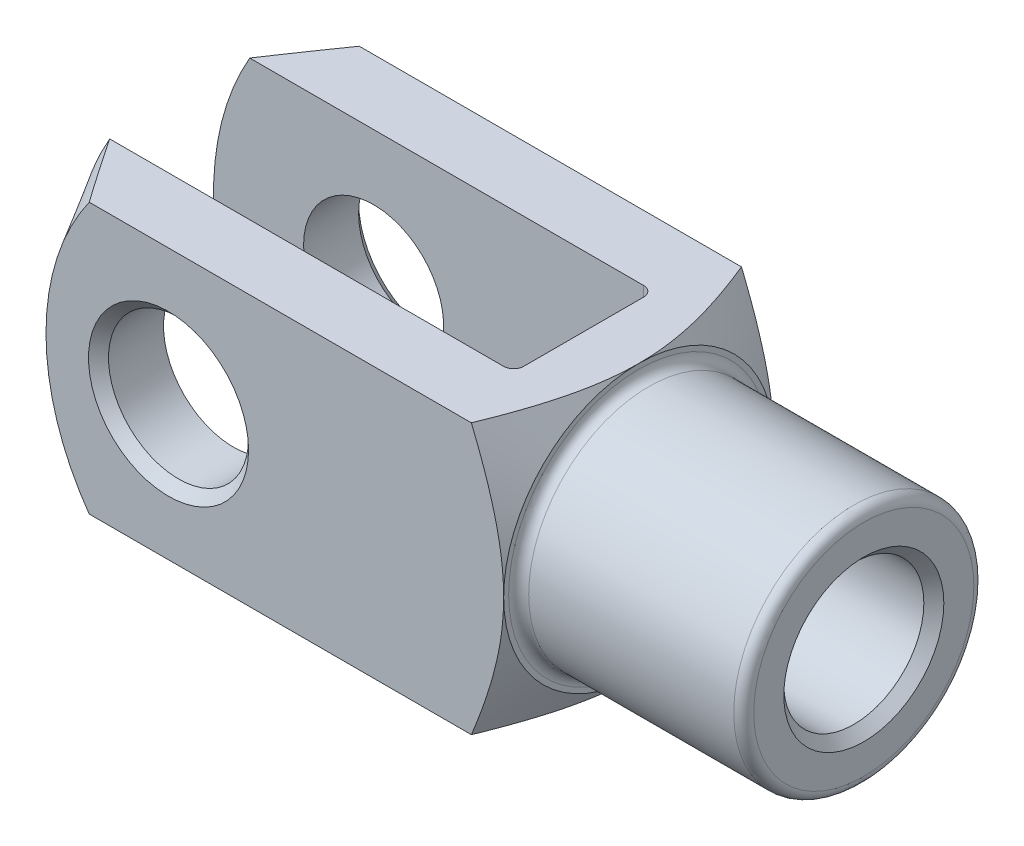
ISO-10303-21;
HEADER;
FILE_DESCRIPTION(('STEP AP214'),'2;1');
FILE_NAME('part.step','',(''),(''),'','','');
FILE_SCHEMA(('AUTOMOTIVE_DESIGN { 1 0 10303 214 1 1 1 1 }'));
ENDSEC;
DATA;
#1=APPLICATION_CONTEXT('core data for automotive mechanical design processes');
#2=APPLICATION_PROTOCOL_DEFINITION('international standard','automotive_design',2000,#1);
#3=PRODUCT_CONTEXT('',#1,'mechanical');
#4=PRODUCT('Part','Part','',(#3));
#5=PRODUCT_RELATED_PRODUCT_CATEGORY('part','',(#4));
#6=PRODUCT_DEFINITION_FORMATION('','',#4);
#7=PRODUCT_DEFINITION_CONTEXT('part definition',#1,'design');
#8=PRODUCT_DEFINITION('design','',#6,#7);
#9=PRODUCT_DEFINITION_SHAPE('','',#8);
#10=(LENGTH_UNIT() NAMED_UNIT(*) SI_UNIT(.MILLI.,.METRE.));
#11=(NAMED_UNIT(*) PLANE_ANGLE_UNIT() SI_UNIT($,.RADIAN.));
#12=(NAMED_UNIT(*) SI_UNIT($,.STERADIAN.) SOLID_ANGLE_UNIT());
#13=UNCERTAINTY_MEASURE_WITH_UNIT(LENGTH_MEASURE(1.E-05),#10,'distance_accuracy_value','');
#14=(GEOMETRIC_REPRESENTATION_CONTEXT(3) GLOBAL_UNCERTAINTY_ASSIGNED_CONTEXT((#13)) GLOBAL_UNIT_ASSIGNED_CONTEXT((#10,
#11,#12)) REPRESENTATION_CONTEXT('',''));
#15=CARTESIAN_POINT('',(0.,0.,0.));
#16=DIRECTION('',(0.,0.,1.));
#17=DIRECTION('',(1.,0.,0.));
#18=AXIS2_PLACEMENT_3D('',#15,#16,#17);
#19=CARTESIAN_POINT('',(-29.,-13.5,-5.99999999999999));
#20=DIRECTION('',(0.,-1.,0.));
#21=DIRECTION('',(0.,0.,-1.));
#22=AXIS2_PLACEMENT_3D('',#19,#20,#21);
#23=CYLINDRICAL_SURFACE('',#22,1.);
#24=DIRECTION('',(0.,1.,0.));
#25=VECTOR('',#24,1.);
#26=CARTESIAN_POINT('',(-28.,-13.5,-5.99999999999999));
#27=LINE('',#26,#25);
#28=CARTESIAN_POINT('',(-28.,-3.60555127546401,-5.99999999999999));
#29=VERTEX_POINT('',#28);
#30=CARTESIAN_POINT('',(-28.,-13.5,-5.99999999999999));
#31=VERTEX_POINT('',#30);
#32=EDGE_CURVE('E358',#29,#31,#27,.F.);
#33=ORIENTED_EDGE('',*,*,#32,.F.);
#34=CARTESIAN_POINT('',(-28.,-3.60555127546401,-5.99999999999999));
#35=CARTESIAN_POINT('',(-28.000007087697,-3.55494177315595,-6.03041382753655));
#36=CARTESIAN_POINT('',(-28.001386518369,-3.50396296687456,-6.06017529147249));
#37=CARTESIAN_POINT('',(-28.0065960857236,-3.40138529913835,-6.11833715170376));
#38=CARTESIAN_POINT('',(-28.0104251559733,-3.3497867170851,-6.14673813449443));
#39=CARTESIAN_POINT('',(-28.0251248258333,-3.19441978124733,-6.22972265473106));
#40=CARTESIAN_POINT('',(-28.0392107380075,-3.08983806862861,-6.28223313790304));
#41=CARTESIAN_POINT('',(-28.0740643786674,-2.87967288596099,-6.38129477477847));
#42=CARTESIAN_POINT('',(-28.0947990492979,-2.77409682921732,-6.42787385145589));
#43=CARTESIAN_POINT('',(-28.1416261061,-2.56173841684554,-6.51542025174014));
#44=CARTESIAN_POINT('',(-28.1677227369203,-2.45495516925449,-6.55638308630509));
#45=CARTESIAN_POINT('',(-28.2462471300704,-2.15662199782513,-6.66259073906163));
#46=CARTESIAN_POINT('',(-28.303304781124,-1.9640983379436,-6.72176788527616));
#47=CARTESIAN_POINT('',(-28.4262418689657,-1.57742895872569,-6.82288362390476));
#48=CARTESIAN_POINT('',(-28.4921270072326,-1.38328226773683,-6.86481100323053));
#49=CARTESIAN_POINT('',(-28.6980114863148,-0.798929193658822,-6.96548017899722));
#50=CARTESIAN_POINT('',(-28.8462392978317,-0.406811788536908,-6.99910832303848));
#51=CARTESIAN_POINT('',(-28.9960560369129,-0.0104348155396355,-6.99999416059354));
#52=CARTESIAN_POINT('',(-28.998028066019,-0.00521731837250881,-6.99999999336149));
#53=CARTESIAN_POINT('',(-29.,0.,-6.99999999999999));
#54=B_SPLINE_CURVE_WITH_KNOTS('',3,(#34,#35,#36,#37,#38,#39,#40,#41,#42,#43,#44,#45,#46,#47,#48,
#49,#50,#51,#52,#53),.UNSPECIFIED.,.F.,.F.,(4,2,2,2,2,2,2,2,2,4),(0.,0.177083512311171,
0.354089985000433,0.707258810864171,1.05869820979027,1.41041689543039,2.03723640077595,
2.66446272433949,3.91892182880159,3.93565503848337),.UNSPECIFIED.);
#55=CARTESIAN_POINT('',(-29.,0.,-6.99999999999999));
#56=VERTEX_POINT('',#55);
#57=EDGE_CURVE('E391',#29,#56,#54,.T.);
#58=ORIENTED_EDGE('',*,*,#57,.T.);
#59=DIRECTION('',(0.,1.,0.));
#60=VECTOR('',#59,1.);
#61=CARTESIAN_POINT('',(-29.,13.5,-6.99999999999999));
#62=LINE('',#61,#60);
#63=CARTESIAN_POINT('',(-29.,-13.5,-6.99999999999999));
#64=VERTEX_POINT('',#63);
#65=EDGE_CURVE('E183',#64,#56,#62,.T.);
#66=ORIENTED_EDGE('',*,*,#65,.F.);
#67=CARTESIAN_POINT('',(-29.,-13.5,-5.99999999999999));
#68=DIRECTION('',(0.,-1.,0.));
#69=DIRECTION('',(0.,0.,-1.));
#70=AXIS2_PLACEMENT_3D('',#67,#68,#69);
#71=CIRCLE('',#70,1.);
#72=EDGE_CURVE('E198',#31,#64,#71,.F.);
#73=ORIENTED_EDGE('',*,*,#72,.F.);
#74=EDGE_LOOP('',(#33,#58,#66,#73));
#75=FACE_BOUND('',#74,.T.);
#76=ADVANCED_FACE('F37',(#75),#23,.F.);
#77=CARTESIAN_POINT('',(-28.,-13.5,-6.99999999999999));
#78=DIRECTION('',(1.,0.,0.));
#79=DIRECTION('',(0.,0.,-1.));
#80=AXIS2_PLACEMENT_3D('',#77,#78,#79);
#81=PLANE('',#80);
#82=CARTESIAN_POINT('',(-28.,13.5,-5.99999999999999));
#83=VERTEX_POINT('',#82);
#84=CARTESIAN_POINT('',(-28.,3.60555127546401,-5.99999999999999));
#85=VERTEX_POINT('',#84);
#86=EDGE_CURVE('E374',#83,#85,#27,.F.);
#87=ORIENTED_EDGE('',*,*,#86,.T.);
#88=CARTESIAN_POINT('',(-28.,0.,0.));
#89=DIRECTION('',(1.,0.,0.));
#90=DIRECTION('',(0.,0.,-1.));
#91=AXIS2_PLACEMENT_3D('',#88,#89,#90);
#92=CIRCLE('',#91,7.);
#93=CARTESIAN_POINT('',(-28.,3.60555127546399,6.));
#94=VERTEX_POINT('',#93);
#95=EDGE_CURVE('E742',#85,#94,#92,.T.);
#96=ORIENTED_EDGE('',*,*,#95,.T.);
#97=DIRECTION('',(0.,1.,0.));
#98=VECTOR('',#97,1.);
#99=CARTESIAN_POINT('',(-28.,13.5,6.));
#100=LINE('',#99,#98);
#101=CARTESIAN_POINT('',(-28.,13.5,6.));
#102=VERTEX_POINT('',#101);
#103=EDGE_CURVE('E160',#94,#102,#100,.T.);
#104=ORIENTED_EDGE('',*,*,#103,.T.);
#105=DIRECTION('',(0.,0.,-1.));
#106=VECTOR('',#105,1.);
#107=CARTESIAN_POINT('',(-28.,13.5,-6.99999999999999));
#108=LINE('',#107,#106);
#109=EDGE_CURVE('E339',#102,#83,#108,.T.);
#110=ORIENTED_EDGE('',*,*,#109,.T.);
#111=EDGE_LOOP('',(#87,#96,#104,#110));
#112=FACE_BOUND('',#111,.T.);
#113=ADVANCED_FACE('F460',(#112),#81,.F.);
#114=CARTESIAN_POINT('',(-29.,-13.5,6.));
#115=DIRECTION('',(0.,-1.,0.));
#116=DIRECTION('',(0.,0.,-1.));
#117=AXIS2_PLACEMENT_3D('',#114,#115,#116);
#118=CYLINDRICAL_SURFACE('',#117,1.);
#119=ORIENTED_EDGE('',*,*,#103,.F.);
#120=CARTESIAN_POINT('',(-28.,3.60555127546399,6.));
#121=CARTESIAN_POINT('',(-28.000007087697,3.5549417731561,6.03041382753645));
#122=CARTESIAN_POINT('',(-28.001386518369,3.50396296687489,6.0601752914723));
#123=CARTESIAN_POINT('',(-28.0065960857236,3.40138529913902,6.11833715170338));
#124=CARTESIAN_POINT('',(-28.0104251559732,3.34978671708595,6.14673813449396));
#125=CARTESIAN_POINT('',(-28.0251248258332,3.19441978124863,6.22972265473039));
#126=CARTESIAN_POINT('',(-28.0392107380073,3.08983806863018,6.28223313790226));
#127=CARTESIAN_POINT('',(-28.0740643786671,2.87967288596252,6.38129477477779));
#128=CARTESIAN_POINT('',(-28.0947990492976,2.77409682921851,6.42787385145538));
#129=CARTESIAN_POINT('',(-28.1416261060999,2.56173841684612,6.51542025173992));
#130=CARTESIAN_POINT('',(-28.1677227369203,2.45495516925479,6.55638308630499));
#131=CARTESIAN_POINT('',(-28.2462471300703,2.15662199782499,6.66259073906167));
#132=CARTESIAN_POINT('',(-28.3033047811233,1.96409833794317,6.72176788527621));
#133=CARTESIAN_POINT('',(-28.4262418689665,1.57742895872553,6.82288362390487));
#134=CARTESIAN_POINT('',(-28.4921270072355,1.38328226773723,6.86481100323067));
#135=CARTESIAN_POINT('',(-28.6980114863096,0.798929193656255,6.96548017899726));
#136=CARTESIAN_POINT('',(-28.8462392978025,0.406811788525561,6.9991083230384));
#137=CARTESIAN_POINT('',(-28.9960560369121,0.0104348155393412,6.99999416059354));
#138=CARTESIAN_POINT('',(-28.9980280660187,0.00521731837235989,6.99999999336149));
#139=CARTESIAN_POINT('',(-29.,0.,7.));
#140=B_SPLINE_CURVE_WITH_KNOTS('',3,(#120,#121,#122,#123,#124,#125,#126,#127,#128,#129,#130,
#131,#132,#133,#134,#135,#136,#137,#138,#139),.UNSPECIFIED.,.F.,.F.,(4,2,2,2,2,2,2,2,2,4),(0.,
0.177083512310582,0.354089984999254,0.707258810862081,1.0586982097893,1.4104168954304,
2.03723640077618,2.66446272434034,3.91892182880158,3.93565503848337),.UNSPECIFIED.);
#141=CARTESIAN_POINT('',(-29.,0.,7.));
#142=VERTEX_POINT('',#141);
#143=EDGE_CURVE('E145',#94,#142,#140,.T.);
#144=ORIENTED_EDGE('',*,*,#143,.T.);
#145=DIRECTION('',(0.,1.,0.));
#146=VECTOR('',#145,1.);
#147=CARTESIAN_POINT('',(-29.,-13.5,7.));
#148=LINE('',#147,#146);
#149=CARTESIAN_POINT('',(-29.,13.5,7.));
#150=VERTEX_POINT('',#149);
#151=EDGE_CURVE('E159',#150,#142,#148,.F.);
#152=ORIENTED_EDGE('',*,*,#151,.F.);
#153=CARTESIAN_POINT('',(-29.,13.5,6.));
#154=DIRECTION('',(0.,1.,0.));
#155=DIRECTION('',(0.,0.,1.));
#156=AXIS2_PLACEMENT_3D('',#153,#154,#155);
#157=CIRCLE('',#156,1.);
#158=EDGE_CURVE('E190',#102,#150,#157,.F.);
#159=ORIENTED_EDGE('',*,*,#158,.F.);
#160=EDGE_LOOP('',(#119,#144,#152,#159));
#161=FACE_BOUND('',#160,.T.);
#162=ADVANCED_FACE('F156',(#161),#118,.F.);
#163=CARTESIAN_POINT('',(-72.,-13.5,-6.99999999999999));
#164=DIRECTION('',(0.,0.,-1.));
#165=DIRECTION('',(-1.,0.,0.));
#166=AXIS2_PLACEMENT_3D('',#163,#164,#165);
#167=PLANE('',#166);
#168=CARTESIAN_POINT('',(-56.,0.,-6.99999999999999));
#169=DIRECTION('',(0.,0.,-1.));
#170=DIRECTION('',(-1.,0.,0.));
#171=AXIS2_PLACEMENT_3D('',#168,#169,#170);
#172=CIRCLE('',#171,7.);
#173=CARTESIAN_POINT('',(-63.,0.,-6.99999999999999));
#174=VERTEX_POINT('',#173);
#175=EDGE_CURVE('E368',#174,#174,#172,.F.);
#176=ORIENTED_EDGE('',*,*,#175,.F.);
#177=EDGE_LOOP('',(#176));
#178=FACE_BOUND('',#177,.T.);
#179=CARTESIAN_POINT('',(-45.,0.,-6.99999999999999));
#180=DIRECTION('',(0.,0.,1.));
#181=DIRECTION('',(1.,0.,0.));
#182=AXIS2_PLACEMENT_3D('',#179,#180,#181);
#183=CIRCLE('',#182,27.);
#184=CARTESIAN_POINT('',(-68.3826859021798,13.5,-6.99999999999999));
#185=VERTEX_POINT('',#184);
#186=CARTESIAN_POINT('',(-68.3826859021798,-13.5,-6.99999999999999));
#187=VERTEX_POINT('',#186);
#188=EDGE_CURVE('E277',#185,#187,#183,.T.);
#189=ORIENTED_EDGE('',*,*,#188,.T.);
#190=DIRECTION('',(-1.,0.,0.));
#191=VECTOR('',#190,1.);
#192=CARTESIAN_POINT('',(-72.,-13.5,-6.99999999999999));
#193=LINE('',#192,#191);
#194=EDGE_CURVE('E334',#64,#187,#193,.T.);
#195=ORIENTED_EDGE('',*,*,#194,.F.);
#196=ORIENTED_EDGE('',*,*,#65,.T.);
#197=CARTESIAN_POINT('',(-29.,13.5,-6.99999999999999));
#198=VERTEX_POINT('',#197);
#199=EDGE_CURVE('E179',#56,#198,#62,.T.);
#200=ORIENTED_EDGE('',*,*,#199,.T.);
#201=DIRECTION('',(-1.,0.,0.));
#202=VECTOR('',#201,1.);
#203=CARTESIAN_POINT('',(-72.,13.5,-6.99999999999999));
#204=LINE('',#203,#202);
#205=EDGE_CURVE('E347',#198,#185,#204,.T.);
#206=ORIENTED_EDGE('',*,*,#205,.T.);
#207=EDGE_LOOP('',(#189,#195,#196,#200,#206));
#208=FACE_BOUND('',#207,.T.);
#209=ADVANCED_FACE('F394',(#178,#208),#167,.F.);
#210=CARTESIAN_POINT('',(-72.,-13.5,7.00000000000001));
#211=DIRECTION('',(0.,0.,1.));
#212=DIRECTION('',(1.,0.,0.));
#213=AXIS2_PLACEMENT_3D('',#210,#211,#212);
#214=PLANE('',#213);
#215=CARTESIAN_POINT('',(-56.,0.,7.));
#216=DIRECTION('',(0.,0.,1.));
#217=DIRECTION('',(1.,0.,0.));
#218=AXIS2_PLACEMENT_3D('',#215,#216,#217);
#219=CIRCLE('',#218,7.);
#220=CARTESIAN_POINT('',(-49.,0.,7.));
#221=VERTEX_POINT('',#220);
#222=EDGE_CURVE('E346',#221,#221,#219,.F.);
#223=ORIENTED_EDGE('',*,*,#222,.F.);
#224=EDGE_LOOP('',(#223));
#225=FACE_BOUND('',#224,.T.);
#226=DIRECTION('',(1.,0.,0.));
#227=VECTOR('',#226,1.);
#228=CARTESIAN_POINT('',(-72.,-13.5,7.00000000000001));
#229=LINE('',#228,#227);
#230=CARTESIAN_POINT('',(-68.3826859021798,-13.5,7.00000000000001));
#231=VERTEX_POINT('',#230);
#232=CARTESIAN_POINT('',(-29.,-13.5,7.));
#233=VERTEX_POINT('',#232);
#234=EDGE_CURVE('E338',#231,#233,#229,.T.);
#235=ORIENTED_EDGE('',*,*,#234,.F.);
#236=CARTESIAN_POINT('',(-45.,0.,7.00000000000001));
#237=DIRECTION('',(0.,0.,1.));
#238=DIRECTION('',(1.,0.,0.));
#239=AXIS2_PLACEMENT_3D('',#236,#237,#238);
#240=CIRCLE('',#239,27.);
#241=CARTESIAN_POINT('',(-68.3826859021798,13.5,7.00000000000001));
#242=VERTEX_POINT('',#241);
#243=EDGE_CURVE('E416',#242,#231,#240,.T.);
#244=ORIENTED_EDGE('',*,*,#243,.F.);
#245=DIRECTION('',(1.,0.,0.));
#246=VECTOR('',#245,1.);
#247=CARTESIAN_POINT('',(-72.,13.5,7.00000000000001));
#248=LINE('',#247,#246);
#249=EDGE_CURVE('E176',#242,#150,#248,.T.);
#250=ORIENTED_EDGE('',*,*,#249,.T.);
#251=ORIENTED_EDGE('',*,*,#151,.T.);
#252=EDGE_CURVE('E164',#142,#233,#148,.F.);
#253=ORIENTED_EDGE('',*,*,#252,.T.);
#254=EDGE_LOOP('',(#235,#244,#250,#251,#253));
#255=FACE_BOUND('',#254,.T.);
#256=ADVANCED_FACE('F173',(#225,#255),#214,.F.);
#257=CARTESIAN_POINT('',(-72.,-13.5,13.5));
#258=DIRECTION('',(0.,0.,1.));
#259=DIRECTION('',(1.,0.,0.));
#260=AXIS2_PLACEMENT_3D('',#257,#258,#259);
#261=PLANE('',#260);
#262=CARTESIAN_POINT('',(-56.,0.,13.5));
#263=DIRECTION('',(0.,0.,1.));
#264=DIRECTION('',(1.,0.,0.));
#265=AXIS2_PLACEMENT_3D('',#262,#263,#264);
#266=CIRCLE('',#265,8.);
#267=CARTESIAN_POINT('',(-48.,0.,13.5));
#268=VERTEX_POINT('',#267);
#269=EDGE_CURVE('E229',#268,#268,#266,.F.);
#270=ORIENTED_EDGE('',*,*,#269,.T.);
#271=EDGE_LOOP('',(#270));
#272=FACE_BOUND('',#271,.T.);
#273=DIRECTION('',(1.,0.,0.));
#274=VECTOR('',#273,1.);
#275=CARTESIAN_POINT('',(-72.,13.5,13.5));
#276=LINE('',#275,#274);
#277=CARTESIAN_POINT('',(-63.9257335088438,13.5,13.5));
#278=VERTEX_POINT('',#277);
#279=CARTESIAN_POINT('',(-25.7284752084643,13.5,13.5));
#280=VERTEX_POINT('',#279);
#281=EDGE_CURVE('E365',#278,#280,#276,.T.);
#282=ORIENTED_EDGE('',*,*,#281,.F.);
#283=CARTESIAN_POINT('',(-45.,0.,13.5));
#284=DIRECTION('',(0.,0.,1.));
#285=DIRECTION('',(1.,0.,0.));
#286=AXIS2_PLACEMENT_3D('',#283,#284,#285);
#287=CIRCLE('',#286,23.2472232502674);
#288=CARTESIAN_POINT('',(-63.9257335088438,-13.5,13.5));
#289=VERTEX_POINT('',#288);
#290=EDGE_CURVE('E61',#278,#289,#287,.T.);
#291=ORIENTED_EDGE('',*,*,#290,.T.);
#292=DIRECTION('',(1.,0.,0.));
#293=VECTOR('',#292,1.);
#294=CARTESIAN_POINT('',(-72.,-13.5,13.5));
#295=LINE('',#294,#293);
#296=CARTESIAN_POINT('',(-25.7284752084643,-13.5,13.5));
#297=VERTEX_POINT('',#296);
#298=EDGE_CURVE('E362',#289,#297,#295,.T.);
#299=ORIENTED_EDGE('',*,*,#298,.T.);
#300=CARTESIAN_POINT('',(-32.4304291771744,-27.5724587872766,13.5));
#301=CARTESIAN_POINT('',(-32.0854679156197,-26.9070980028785,13.5));
#302=CARTESIAN_POINT('',(-31.742330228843,-26.240782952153,13.5));
#303=CARTESIAN_POINT('',(-31.0606693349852,-24.9057532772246,13.5));
#304=CARTESIAN_POINT('',(-30.722146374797,-24.2370385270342,13.5));
#305=CARTESIAN_POINT('',(-30.0501346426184,-22.8956223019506,13.5));
#306=CARTESIAN_POINT('',(-29.7166556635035,-22.2229159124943,13.5));
#307=CARTESIAN_POINT('',(-29.0567154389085,-20.8740781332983,13.5));
#308=CARTESIAN_POINT('',(-28.7302540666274,-20.1979468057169,13.5));
#309=CARTESIAN_POINT('',(-28.0663268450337,-18.7997650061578,13.5));
#310=CARTESIAN_POINT('',(-27.7294196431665,-18.0774486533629,13.5));
#311=CARTESIAN_POINT('',(-27.0684159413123,-16.6268968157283,13.5));
#312=CARTESIAN_POINT('',(-26.7443201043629,-15.8986610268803,13.5));
#313=CARTESIAN_POINT('',(-26.2709527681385,-14.8009827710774,13.5));
#314=CARTESIAN_POINT('',(-26.1153242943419,-14.4342798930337,13.5));
#315=CARTESIAN_POINT('',(-25.8089711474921,-13.6988341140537,13.5));
#316=CARTESIAN_POINT('',(-25.6582463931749,-13.3300912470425,13.5));
#317=CARTESIAN_POINT('',(-25.3624766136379,-12.5903643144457,13.5));
#318=CARTESIAN_POINT('',(-25.217431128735,-12.2193804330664,13.5));
#319=CARTESIAN_POINT('',(-24.9339241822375,-11.4749116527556,13.5));
#320=CARTESIAN_POINT('',(-24.7954625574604,-11.1014268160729,13.5));
#321=CARTESIAN_POINT('',(-24.4969840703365,-10.2704027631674,13.5));
#322=CARTESIAN_POINT('',(-24.3388043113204,-9.81219978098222,13.5));
#323=CARTESIAN_POINT('',(-24.0360567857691,-8.89133812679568,13.5));
#324=CARTESIAN_POINT('',(-23.8914878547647,-8.42867983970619,13.5));
#325=CARTESIAN_POINT('',(-23.6186454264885,-7.49855908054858,13.5));
#326=CARTESIAN_POINT('',(-23.4903715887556,-7.03109670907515,13.5));
#327=CARTESIAN_POINT('',(-23.253182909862,-6.09124666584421,13.5));
#328=CARTESIAN_POINT('',(-23.1442678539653,-5.61885904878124,13.5));
#329=CARTESIAN_POINT('',(-22.9513715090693,-4.68052707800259,13.5));
#330=CARTESIAN_POINT('',(-22.8668649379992,-4.21469177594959,13.5));
#331=CARTESIAN_POINT('',(-22.7224231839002,-3.27919491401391,13.5));
#332=CARTESIAN_POINT('',(-22.662487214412,-2.80953347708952,13.5));
#333=CARTESIAN_POINT('',(-22.5696920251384,-1.86781820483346,13.5));
#334=CARTESIAN_POINT('',(-22.5368151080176,-1.39576613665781,13.5));
#335=CARTESIAN_POINT('',(-22.4995884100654,-0.450533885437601,13.5));
#336=CARTESIAN_POINT('',(-22.4952376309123,0.0226462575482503,13.5));
#337=CARTESIAN_POINT('',(-22.5145298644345,0.933916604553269,13.5));
#338=CARTESIAN_POINT('',(-22.5361561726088,1.37205133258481,13.5));
#339=CARTESIAN_POINT('',(-22.6032147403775,2.24647569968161,13.5));
#340=CARTESIAN_POINT('',(-22.6486469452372,2.68276534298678,13.5));
#341=CARTESIAN_POINT('',(-22.7616517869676,3.55266413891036,13.5));
#342=CARTESIAN_POINT('',(-22.8292358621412,3.98627178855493,13.5));
#343=CARTESIAN_POINT('',(-22.9843161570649,4.84988834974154,13.5));
#344=CARTESIAN_POINT('',(-23.0718129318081,5.27989716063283,13.5));
#345=CARTESIAN_POINT('',(-23.2670701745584,6.14834375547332,13.5));
#346=CARTESIAN_POINT('',(-23.3753438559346,6.58666526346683,13.5));
#347=CARTESIAN_POINT('',(-23.6077854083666,7.4590443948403,13.5));
#348=CARTESIAN_POINT('',(-23.7319534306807,7.89310197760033,13.5));
#349=CARTESIAN_POINT('',(-23.9937810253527,8.75708887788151,13.5));
#350=CARTESIAN_POINT('',(-24.1314399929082,9.18701837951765,13.5));
#351=CARTESIAN_POINT('',(-24.3464699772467,9.82901563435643,13.5));
#352=CARTESIAN_POINT('',(-24.4195690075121,10.0425285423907,13.5));
#353=CARTESIAN_POINT('',(-24.568387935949,10.4686386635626,13.5));
#354=CARTESIAN_POINT('',(-24.6441078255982,10.6812358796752,13.5));
#355=CARTESIAN_POINT('',(-24.8874050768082,11.3522977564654,13.5));
#356=CARTESIAN_POINT('',(-25.0593999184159,11.809164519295,13.5));
#357=CARTESIAN_POINT('',(-25.4127281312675,12.7192834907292,13.5));
#358=CARTESIAN_POINT('',(-25.5940620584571,13.1725354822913,13.5));
#359=CARTESIAN_POINT('',(-25.9645603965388,14.0759400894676,13.5));
#360=CARTESIAN_POINT('',(-26.1537265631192,14.5260919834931,13.5));
#361=CARTESIAN_POINT('',(-26.5385867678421,15.4235797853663,13.5));
#362=CARTESIAN_POINT('',(-26.7342806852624,15.8709157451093,13.5));
#363=CARTESIAN_POINT('',(-27.1313434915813,16.7635184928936,13.5));
#364=CARTESIAN_POINT('',(-27.3327171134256,17.2087831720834,13.5));
#365=CARTESIAN_POINT('',(-27.7401463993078,18.0971674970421,13.5));
#366=CARTESIAN_POINT('',(-27.9462021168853,18.540287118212,13.5));
#367=CARTESIAN_POINT('',(-28.5702761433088,19.8667324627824,13.5));
#368=CARTESIAN_POINT('',(-28.994251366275,20.7472561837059,13.5));
#369=CARTESIAN_POINT('',(-29.8552271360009,22.5052140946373,13.5));
#370=CARTESIAN_POINT('',(-30.2922634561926,23.3826306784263,13.5));
#371=CARTESIAN_POINT('',(-31.175287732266,25.1329651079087,13.5));
#372=CARTESIAN_POINT('',(-31.6212758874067,26.0058828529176,13.5));
#373=CARTESIAN_POINT('',(-32.5199360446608,27.7477195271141,13.5));
#374=CARTESIAN_POINT('',(-32.9726046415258,28.6166402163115,13.5));
#375=CARTESIAN_POINT('',(-33.8833677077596,30.3516218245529,13.5));
#376=CARTESIAN_POINT('',(-34.3414621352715,31.2176827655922,13.5));
#377=CARTESIAN_POINT('',(-35.1936403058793,32.8190461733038,13.5));
#378=CARTESIAN_POINT('',(-35.587127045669,33.5546666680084,13.5));
#379=CARTESIAN_POINT('',(-36.3767395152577,35.0244904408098,13.5));
#380=CARTESIAN_POINT('',(-36.7728652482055,35.7586937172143,13.5));
#381=CARTESIAN_POINT('',(-37.9646720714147,37.959711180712,13.5));
#382=CARTESIAN_POINT('',(-38.7636731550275,39.4247275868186,13.5));
#383=CARTESIAN_POINT('',(-40.3635150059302,42.3428467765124,13.5));
#384=CARTESIAN_POINT('',(-41.1643190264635,43.7959697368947,13.5));
#385=CARTESIAN_POINT('',(-42.3690675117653,45.973543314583,13.5));
#386=CARTESIAN_POINT('',(-42.7712089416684,46.6989923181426,13.5));
#387=CARTESIAN_POINT('',(-43.5765516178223,48.1493007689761,13.5));
#388=CARTESIAN_POINT('',(-43.9797528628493,48.8741602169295,13.5));
#389=CARTESIAN_POINT('',(-44.3834136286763,49.5987636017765,13.5));
#390=B_SPLINE_CURVE_WITH_KNOTS('',3,(#300,#301,#302,#303,#304,#305,#306,#307,#308,#309,#310,
#311,#312,#313,#314,#315,#316,#317,#318,#319,#320,#321,#322,#323,#324,#325,#326,#327,#328,#329,
#330,#331,#332,#333,#334,#335,#336,#337,#338,#339,#340,#341,#342,#343,#344,#345,#346,#347,#348,
#349,#350,#351,#352,#353,#354,#355,#356,#357,#358,#359,#360,#361,#362,#363,#364,#365,#366,#367,
#368,#369,#370,#371,#372,#373,#374,#375,#376,#377,#378,#379,#380,#381,#382,#383,#384,#385,#386,
#387,#388,#389),.UNSPECIFIED.,.F.,.F.,(4,2,2,2,2,2,2,2,2,2,2,2,2,2,2,2,2,2,2,2,2,2,2,2,2,2,2,2,
2,2,2,2,2,2,2,2,2,2,2,2,2,2,2,2,4),(0.,2.24841482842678,4.49694948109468,6.7493996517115,
9.00180908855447,11.3927930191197,13.7839005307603,14.9789541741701,16.1739880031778,
17.3689249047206,18.5638321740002,20.0178658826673,21.4717750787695,22.9256538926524,
24.379516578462,25.7992511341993,27.2189402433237,28.6377000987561,30.0564103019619,
31.3717442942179,32.6870752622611,34.0030864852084,35.3191343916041,36.6732741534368,
38.0274268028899,39.3815187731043,40.0585434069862,40.7355658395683,42.1999363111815,
43.6643940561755,45.1291818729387,46.5939426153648,48.0599622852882,49.5259987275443,
52.4577049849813,55.3983502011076,58.3390609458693,61.2783212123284,64.2175588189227,
66.7202960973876,69.2230363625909,74.2292153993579,79.2067218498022,81.6950831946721,
84.1834416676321),.UNSPECIFIED.);
#391=CARTESIAN_POINT('',(-22.5,0.,13.5));
#392=VERTEX_POINT('',#391);
#393=EDGE_CURVE('E306',#392,#297,#390,.F.);
#394=ORIENTED_EDGE('',*,*,#393,.F.);
#395=EDGE_CURVE('E304',#280,#392,#390,.F.);
#396=ORIENTED_EDGE('',*,*,#395,.F.);
#397=EDGE_LOOP('',(#282,#291,#299,#394,#396));
#398=FACE_BOUND('',#397,.T.);
#399=ADVANCED_FACE('F288',(#272,#398),#261,.T.);
#400=CARTESIAN_POINT('',(-72.,-13.5,13.5));
#401=DIRECTION('',(0.,-1.,0.));
#402=DIRECTION('',(0.,0.,-1.));
#403=AXIS2_PLACEMENT_3D('',#400,#401,#402);
#404=PLANE('',#403);
#405=ORIENTED_EDGE('',*,*,#194,.T.);
#406=CARTESIAN_POINT('',(-85.3353783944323,-13.5,19.9067277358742));
#407=CARTESIAN_POINT('',(-84.5897429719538,-13.5,18.6820817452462));
#408=CARTESIAN_POINT('',(-83.8426357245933,-13.5,17.4583291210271));
#409=CARTESIAN_POINT('',(-82.3448194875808,-13.5,15.0130165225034));
#410=CARTESIAN_POINT('',(-81.59411046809,-13.5,13.7914565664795));
#411=CARTESIAN_POINT('',(-80.0883557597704,-13.5,11.350810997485));
#412=CARTESIAN_POINT('',(-79.3333095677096,-13.5,10.1317256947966));
#413=CARTESIAN_POINT('',(-77.8180938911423,-13.5,7.69674639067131));
#414=CARTESIAN_POINT('',(-77.0579244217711,-13.5,6.48085237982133));
#415=CARTESIAN_POINT('',(-75.5330177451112,-13.5,4.05566502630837));
#416=CARTESIAN_POINT('',(-74.7682942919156,-13.5,2.84636304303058));
#417=CARTESIAN_POINT('',(-73.2311470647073,-13.5,0.432665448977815));
#418=CARTESIAN_POINT('',(-72.4587233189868,-13.5,-0.771730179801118));
#419=CARTESIAN_POINT('',(-70.9041541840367,-13.5,-3.1743133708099));
#420=CARTESIAN_POINT('',(-70.1220084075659,-13.5,-4.37250068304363));
#421=CARTESIAN_POINT('',(-68.9394271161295,-13.5,-6.1635918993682));
#422=CARTESIAN_POINT('',(-68.5436743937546,-13.5,-6.75958848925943));
#423=CARTESIAN_POINT('',(-67.7485806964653,-13.5,-7.94918226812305));
#424=CARTESIAN_POINT('',(-67.3492397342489,-13.5,-8.54277946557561));
#425=CARTESIAN_POINT('',(-66.5457822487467,-13.5,-9.72812510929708));
#426=CARTESIAN_POINT('',(-66.1416590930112,-13.5,-10.319869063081));
#427=CARTESIAN_POINT('',(-65.328600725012,-13.5,-11.500038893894));
#428=CARTESIAN_POINT('',(-64.9196655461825,-13.5,-12.0884647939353));
#429=CARTESIAN_POINT('',(-64.096256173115,-13.5,-13.2612199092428));
#430=CARTESIAN_POINT('',(-63.6817833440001,-13.5,-13.845550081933));
#431=CARTESIAN_POINT('',(-62.8461635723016,-13.5,-15.0094493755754));
#432=CARTESIAN_POINT('',(-62.4250164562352,-13.5,-15.5890183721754));
#433=CARTESIAN_POINT('',(-61.5742466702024,-13.5,-16.7429906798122));
#434=CARTESIAN_POINT('',(-61.1446143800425,-13.5,-17.3173869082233));
#435=CARTESIAN_POINT('',(-60.2757290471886,-13.5,-18.4588171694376));
#436=CARTESIAN_POINT('',(-59.8364767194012,-13.5,-19.0258517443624));
#437=CARTESIAN_POINT('',(-59.1685494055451,-13.5,-19.869590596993));
#438=CARTESIAN_POINT('',(-58.9443098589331,-13.5,-20.1498090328));
#439=CARTESIAN_POINT('',(-58.4925201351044,-13.5,-20.7075596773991));
#440=CARTESIAN_POINT('',(-58.2649700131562,-13.5,-20.9850919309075));
#441=CARTESIAN_POINT('',(-57.8061154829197,-13.5,-21.5371561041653));
#442=CARTESIAN_POINT('',(-57.5748101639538,-13.5,-21.8116872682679));
#443=CARTESIAN_POINT('',(-57.108015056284,-13.5,-22.3571941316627));
#444=CARTESIAN_POINT('',(-56.8725250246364,-13.5,-22.6281696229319));
#445=CARTESIAN_POINT('',(-56.6347136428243,-13.5,-22.8971084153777));
#446=B_SPLINE_CURVE_WITH_KNOTS('',3,(#406,#407,#408,#409,#410,#411,#412,#413,#414,#415,#416,
#417,#418,#419,#420,#421,#422,#423,#424,#425,#426,#427,#428,#429,#430,#431,#432,#433,#434,#435,
#436,#437,#438,#439,#440,#441,#442,#443,#444,#445),.UNSPECIFIED.,.F.,.F.,(4,2,2,2,2,2,2,2,2,2,2,
2,2,2,2,2,2,2,2,4),(0.,4.30134760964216,8.60273091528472,12.904623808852,17.2065039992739,
21.4989060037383,25.7912922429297,30.0838500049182,32.2301130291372,34.376368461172,
36.5260664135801,38.6757494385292,40.8249119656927,42.9741304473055,45.1259441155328,
47.2775984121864,48.3542633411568,49.4309103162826,50.5078224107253,51.5847972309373),.UNSPECIFIED.);
#447=CARTESIAN_POINT('',(-63.9257335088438,-13.5,-13.5));
#448=VERTEX_POINT('',#447);
#449=EDGE_CURVE('E276',#187,#448,#446,.T.);
#450=ORIENTED_EDGE('',*,*,#449,.T.);
#451=DIRECTION('',(1.,0.,0.));
#452=VECTOR('',#451,1.);
#453=CARTESIAN_POINT('',(-72.,-13.5,-13.5));
#454=LINE('',#453,#452);
#455=CARTESIAN_POINT('',(-25.7284752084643,-13.5,-13.5));
#456=VERTEX_POINT('',#455);
#457=EDGE_CURVE('E359',#448,#456,#454,.T.);
#458=ORIENTED_EDGE('',*,*,#457,.T.);
#459=CARTESIAN_POINT('',(-32.4304291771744,-13.5,-27.5724587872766));
#460=CARTESIAN_POINT('',(-32.0854679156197,-13.5,-26.9070980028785));
#461=CARTESIAN_POINT('',(-31.742330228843,-13.5,-26.240782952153));
#462=CARTESIAN_POINT('',(-31.0606693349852,-13.5,-24.9057532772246));
#463=CARTESIAN_POINT('',(-30.722146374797,-13.5,-24.2370385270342));
#464=CARTESIAN_POINT('',(-30.0501346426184,-13.5,-22.8956223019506));
#465=CARTESIAN_POINT('',(-29.7166556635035,-13.5,-22.2229159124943));
#466=CARTESIAN_POINT('',(-29.0567154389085,-13.5,-20.8740781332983));
#467=CARTESIAN_POINT('',(-28.7302540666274,-13.5,-20.1979468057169));
#468=CARTESIAN_POINT('',(-28.0663268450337,-13.5,-18.7997650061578));
#469=CARTESIAN_POINT('',(-27.7294196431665,-13.5,-18.0774486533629));
#470=CARTESIAN_POINT('',(-27.0684159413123,-13.5,-16.6268968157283));
#471=CARTESIAN_POINT('',(-26.7443201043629,-13.5,-15.8986610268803));
#472=CARTESIAN_POINT('',(-26.2709527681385,-13.5,-14.8009827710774));
#473=CARTESIAN_POINT('',(-26.1153242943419,-13.5,-14.4342798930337));
#474=CARTESIAN_POINT('',(-25.8089711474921,-13.5,-13.6988341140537));
#475=CARTESIAN_POINT('',(-25.6582463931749,-13.5,-13.3300912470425));
#476=CARTESIAN_POINT('',(-25.3624766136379,-13.5,-12.5903643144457));
#477=CARTESIAN_POINT('',(-25.217431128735,-13.5,-12.2193804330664));
#478=CARTESIAN_POINT('',(-24.9339241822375,-13.5,-11.4749116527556));
#479=CARTESIAN_POINT('',(-24.7954625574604,-13.5,-11.1014268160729));
#480=CARTESIAN_POINT('',(-24.4969840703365,-13.5,-10.2704027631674));
#481=CARTESIAN_POINT('',(-24.3388043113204,-13.5,-9.81219978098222));
#482=CARTESIAN_POINT('',(-24.0360567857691,-13.5,-8.89133812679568));
#483=CARTESIAN_POINT('',(-23.8914878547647,-13.5,-8.42867983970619));
#484=CARTESIAN_POINT('',(-23.6186454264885,-13.5,-7.49855908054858));
#485=CARTESIAN_POINT('',(-23.4903715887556,-13.5,-7.03109670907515));
#486=CARTESIAN_POINT('',(-23.253182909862,-13.5,-6.09124666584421));
#487=CARTESIAN_POINT('',(-23.1442678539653,-13.5,-5.61885904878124));
#488=CARTESIAN_POINT('',(-22.9513715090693,-13.5,-4.68052707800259));
#489=CARTESIAN_POINT('',(-22.8668649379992,-13.5,-4.21469177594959));
#490=CARTESIAN_POINT('',(-22.7224231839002,-13.5,-3.27919491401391));
#491=CARTESIAN_POINT('',(-22.662487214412,-13.5,-2.80953347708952));
#492=CARTESIAN_POINT('',(-22.5696920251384,-13.5,-1.86781820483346));
#493=CARTESIAN_POINT('',(-22.5368151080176,-13.5,-1.39576613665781));
#494=CARTESIAN_POINT('',(-22.4995884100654,-13.5,-0.450533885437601));
#495=CARTESIAN_POINT('',(-22.4952376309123,-13.5,0.0226462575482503));
#496=CARTESIAN_POINT('',(-22.5145298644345,-13.5,0.933916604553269));
#497=CARTESIAN_POINT('',(-22.5361561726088,-13.5,1.37205133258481));
#498=CARTESIAN_POINT('',(-22.6032147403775,-13.5,2.24647569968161));
#499=CARTESIAN_POINT('',(-22.6486469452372,-13.5,2.68276534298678));
#500=CARTESIAN_POINT('',(-22.7616517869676,-13.5,3.55266413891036));
#501=CARTESIAN_POINT('',(-22.8292358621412,-13.5,3.98627178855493));
#502=CARTESIAN_POINT('',(-22.9843161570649,-13.5,4.84988834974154));
#503=CARTESIAN_POINT('',(-23.0718129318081,-13.5,5.27989716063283));
#504=CARTESIAN_POINT('',(-23.2670701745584,-13.5,6.14834375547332));
#505=CARTESIAN_POINT('',(-23.3753438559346,-13.5,6.58666526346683));
#506=CARTESIAN_POINT('',(-23.6077854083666,-13.5,7.4590443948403));
#507=CARTESIAN_POINT('',(-23.7319534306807,-13.5,7.89310197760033));
#508=CARTESIAN_POINT('',(-23.9937810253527,-13.5,8.75708887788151));
#509=CARTESIAN_POINT('',(-24.1314399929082,-13.5,9.18701837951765));
#510=CARTESIAN_POINT('',(-24.3464699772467,-13.5,9.82901563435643));
#511=CARTESIAN_POINT('',(-24.4195690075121,-13.5,10.0425285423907));
#512=CARTESIAN_POINT('',(-24.568387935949,-13.5,10.4686386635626));
#513=CARTESIAN_POINT('',(-24.6441078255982,-13.5,10.6812358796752));
#514=CARTESIAN_POINT('',(-24.8874050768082,-13.5,11.3522977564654));
#515=CARTESIAN_POINT('',(-25.0593999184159,-13.5,11.809164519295));
#516=CARTESIAN_POINT('',(-25.4127281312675,-13.5,12.7192834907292));
#517=CARTESIAN_POINT('',(-25.5940620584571,-13.5,13.1725354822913));
#518=CARTESIAN_POINT('',(-25.9645603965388,-13.5,14.0759400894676));
#519=CARTESIAN_POINT('',(-26.1537265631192,-13.5,14.5260919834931));
#520=CARTESIAN_POINT('',(-26.5385867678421,-13.5,15.4235797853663));
#521=CARTESIAN_POINT('',(-26.7342806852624,-13.5,15.8709157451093));
#522=CARTESIAN_POINT('',(-27.1313434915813,-13.5,16.7635184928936));
#523=CARTESIAN_POINT('',(-27.3327171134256,-13.5,17.2087831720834));
#524=CARTESIAN_POINT('',(-27.7401463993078,-13.5,18.0971674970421));
#525=CARTESIAN_POINT('',(-27.9462021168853,-13.5,18.540287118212));
#526=CARTESIAN_POINT('',(-28.5702761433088,-13.5,19.8667324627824));
#527=CARTESIAN_POINT('',(-28.994251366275,-13.5,20.7472561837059));
#528=CARTESIAN_POINT('',(-29.8552271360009,-13.5,22.5052140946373));
#529=CARTESIAN_POINT('',(-30.2922634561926,-13.5,23.3826306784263));
#530=CARTESIAN_POINT('',(-31.175287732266,-13.5,25.1329651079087));
#531=CARTESIAN_POINT('',(-31.6212758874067,-13.5,26.0058828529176));
#532=CARTESIAN_POINT('',(-32.5199360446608,-13.5,27.7477195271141));
#533=CARTESIAN_POINT('',(-32.9726046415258,-13.5,28.6166402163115));
#534=CARTESIAN_POINT('',(-33.8833677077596,-13.5,30.3516218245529));
#535=CARTESIAN_POINT('',(-34.3414621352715,-13.5,31.2176827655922));
#536=CARTESIAN_POINT('',(-35.1936403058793,-13.5,32.8190461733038));
#537=CARTESIAN_POINT('',(-35.587127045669,-13.5,33.5546666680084));
#538=CARTESIAN_POINT('',(-36.3767395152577,-13.5,35.0244904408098));
#539=CARTESIAN_POINT('',(-36.7728652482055,-13.5,35.7586937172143));
#540=CARTESIAN_POINT('',(-37.9646720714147,-13.5,37.959711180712));
#541=CARTESIAN_POINT('',(-38.7636731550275,-13.5,39.4247275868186));
#542=CARTESIAN_POINT('',(-40.3635150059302,-13.5,42.3428467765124));
#543=CARTESIAN_POINT('',(-41.1643190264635,-13.5,43.7959697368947));
#544=CARTESIAN_POINT('',(-42.3690675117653,-13.5,45.973543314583));
#545=CARTESIAN_POINT('',(-42.7712089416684,-13.5,46.6989923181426));
#546=CARTESIAN_POINT('',(-43.5765516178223,-13.5,48.1493007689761));
#547=CARTESIAN_POINT('',(-43.9797528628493,-13.5,48.8741602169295));
#548=CARTESIAN_POINT('',(-44.3834136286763,-13.5,49.5987636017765));
#549=B_SPLINE_CURVE_WITH_KNOTS('',3,(#459,#460,#461,#462,#463,#464,#465,#466,#467,#468,#469,
#470,#471,#472,#473,#474,#475,#476,#477,#478,#479,#480,#481,#482,#483,#484,#485,#486,#487,#488,
#489,#490,#491,#492,#493,#494,#495,#496,#497,#498,#499,#500,#501,#502,#503,#504,#505,#506,#507,
#508,#509,#510,#511,#512,#513,#514,#515,#516,#517,#518,#519,#520,#521,#522,#523,#524,#525,#526,
#527,#528,#529,#530,#531,#532,#533,#534,#535,#536,#537,#538,#539,#540,#541,#542,#543,#544,#545,
#546,#547,#548),.UNSPECIFIED.,.F.,.F.,(4,2,2,2,2,2,2,2,2,2,2,2,2,2,2,2,2,2,2,2,2,2,2,2,2,2,2,2,
2,2,2,2,2,2,2,2,2,2,2,2,2,2,2,2,4),(0.,2.24841482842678,4.49694948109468,6.7493996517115,
9.00180908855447,11.3927930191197,13.7839005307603,14.9789541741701,16.1739880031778,
17.3689249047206,18.5638321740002,20.0178658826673,21.4717750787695,22.9256538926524,
24.379516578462,25.7992511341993,27.2189402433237,28.6377000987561,30.0564103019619,
31.3717442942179,32.6870752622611,34.0030864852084,35.3191343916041,36.6732741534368,
38.0274268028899,39.3815187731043,40.0585434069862,40.7355658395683,42.1999363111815,
43.6643940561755,45.1291818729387,46.5939426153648,48.0599622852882,49.5259987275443,
52.4577049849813,55.3983502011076,58.3390609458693,61.2783212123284,64.2175588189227,
66.7202960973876,69.2230363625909,74.2292153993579,79.2067218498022,81.6950831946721,
84.1834416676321),.UNSPECIFIED.);
#550=CARTESIAN_POINT('',(-22.5,-13.5,0.));
#551=VERTEX_POINT('',#550);
#552=EDGE_CURVE('E305',#551,#456,#549,.F.);
#553=ORIENTED_EDGE('',*,*,#552,.F.);
#554=EDGE_CURVE('E296',#297,#551,#549,.F.);
#555=ORIENTED_EDGE('',*,*,#554,.F.);
#556=ORIENTED_EDGE('',*,*,#298,.F.);
#557=CARTESIAN_POINT('',(-56.6347136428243,-13.5,22.8971084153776));
#558=CARTESIAN_POINT('',(-56.8725250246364,-13.5,22.6281696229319));
#559=CARTESIAN_POINT('',(-57.108015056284,-13.5,22.3571941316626));
#560=CARTESIAN_POINT('',(-57.5748101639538,-13.5,21.8116872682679));
#561=CARTESIAN_POINT('',(-57.8061154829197,-13.5,21.5371561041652));
#562=CARTESIAN_POINT('',(-58.2649700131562,-13.5,20.9850919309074));
#563=CARTESIAN_POINT('',(-58.4925201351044,-13.5,20.7075596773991));
#564=CARTESIAN_POINT('',(-58.9443098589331,-13.5,20.1498090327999));
#565=CARTESIAN_POINT('',(-59.168549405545,-13.5,19.869590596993));
#566=CARTESIAN_POINT('',(-59.8364767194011,-13.5,19.0258517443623));
#567=CARTESIAN_POINT('',(-60.2757290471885,-13.5,18.4588171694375));
#568=CARTESIAN_POINT('',(-61.1446143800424,-13.5,17.3173869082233));
#569=CARTESIAN_POINT('',(-61.5742466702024,-13.5,16.7429906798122));
#570=CARTESIAN_POINT('',(-62.4250164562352,-13.5,15.5890183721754));
#571=CARTESIAN_POINT('',(-62.8461635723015,-13.5,15.0094493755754));
#572=CARTESIAN_POINT('',(-63.6817833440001,-13.5,13.8455500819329));
#573=CARTESIAN_POINT('',(-64.096256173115,-13.5,13.2612199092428));
#574=CARTESIAN_POINT('',(-64.9196655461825,-13.5,12.0884647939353));
#575=CARTESIAN_POINT('',(-65.328600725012,-13.5,11.500038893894));
#576=CARTESIAN_POINT('',(-66.1416590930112,-13.5,10.319869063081));
#577=CARTESIAN_POINT('',(-66.5457822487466,-13.5,9.72812510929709));
#578=CARTESIAN_POINT('',(-67.3492397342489,-13.5,8.54277946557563));
#579=CARTESIAN_POINT('',(-67.7485806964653,-13.5,7.94918226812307));
#580=CARTESIAN_POINT('',(-68.5436743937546,-13.5,6.75958848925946));
#581=CARTESIAN_POINT('',(-68.9394271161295,-13.5,6.16359189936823));
#582=CARTESIAN_POINT('',(-70.1220084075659,-13.5,4.37250068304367));
#583=CARTESIAN_POINT('',(-70.9041541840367,-13.5,3.17431337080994));
#584=CARTESIAN_POINT('',(-72.4587233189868,-13.5,0.771730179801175));
#585=CARTESIAN_POINT('',(-73.2311470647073,-13.5,-0.432665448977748));
#586=CARTESIAN_POINT('',(-74.7682942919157,-13.5,-2.84636304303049));
#587=CARTESIAN_POINT('',(-75.5330177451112,-13.5,-4.05566502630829));
#588=CARTESIAN_POINT('',(-77.0579244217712,-13.5,-6.48085237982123));
#589=CARTESIAN_POINT('',(-77.8180938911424,-13.5,-7.6967463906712));
#590=CARTESIAN_POINT('',(-79.3333095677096,-13.5,-10.1317256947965));
#591=CARTESIAN_POINT('',(-80.0883557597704,-13.5,-11.3508109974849));
#592=CARTESIAN_POINT('',(-81.5941104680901,-13.5,-13.7914565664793));
#593=CARTESIAN_POINT('',(-82.3448194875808,-13.5,-15.0130165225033));
#594=CARTESIAN_POINT('',(-83.8426357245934,-13.5,-17.4583291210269));
#595=CARTESIAN_POINT('',(-84.5897429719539,-13.5,-18.6820817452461));
#596=CARTESIAN_POINT('',(-85.3353783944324,-13.5,-19.906727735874));
#597=B_SPLINE_CURVE_WITH_KNOTS('',3,(#557,#558,#559,#560,#561,#562,#563,#564,#565,#566,#567,
#568,#569,#570,#571,#572,#573,#574,#575,#576,#577,#578,#579,#580,#581,#582,#583,#584,#585,#586,
#587,#588,#589,#590,#591,#592,#593,#594,#595,#596),.UNSPECIFIED.,.F.,.F.,(4,2,2,2,2,2,2,2,2,2,2,
2,2,2,2,2,2,2,2,4),(0.,1.07697482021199,2.15388691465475,3.23053388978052,4.3071988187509,
6.45885311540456,8.61066678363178,10.7598852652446,12.9090477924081,15.0587308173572,
17.2084287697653,19.3546842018,21.500947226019,25.7935049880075,30.0858912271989,
34.3782932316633,38.6801734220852,42.9820663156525,47.283449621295,51.5847972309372),.UNSPECIFIED.);
#598=EDGE_CURVE('E267',#289,#231,#597,.T.);
#599=ORIENTED_EDGE('',*,*,#598,.T.);
#600=ORIENTED_EDGE('',*,*,#234,.T.);
#601=CARTESIAN_POINT('',(-29.,-13.5,6.));
#602=DIRECTION('',(0.,-1.,0.));
#603=DIRECTION('',(0.,0.,-1.));
#604=AXIS2_PLACEMENT_3D('',#601,#602,#603);
#605=CIRCLE('',#604,1.);
#606=CARTESIAN_POINT('',(-28.,-13.5,6.));
#607=VERTEX_POINT('',#606);
#608=EDGE_CURVE('E166',#233,#607,#605,.F.);
#609=ORIENTED_EDGE('',*,*,#608,.T.);
#610=DIRECTION('',(0.,0.,-1.));
#611=VECTOR('',#610,1.);
#612=CARTESIAN_POINT('',(-28.,-13.5,-6.99999999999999));
#613=LINE('',#612,#611);
#614=EDGE_CURVE('E342',#607,#31,#613,.T.);
#615=ORIENTED_EDGE('',*,*,#614,.T.);
#616=ORIENTED_EDGE('',*,*,#72,.T.);
#617=EDGE_LOOP('',(#405,#450,#458,#553,#555,#556,#599,#600,#609,#615,#616));
#618=FACE_BOUND('',#617,.T.);
#619=ADVANCED_FACE('F283',(#618),#404,.T.);
#620=CARTESIAN_POINT('',(-72.,-13.5,-13.5));
#621=DIRECTION('',(0.,0.,-1.));
#622=DIRECTION('',(-1.,0.,0.));
#623=AXIS2_PLACEMENT_3D('',#620,#621,#622);
#624=PLANE('',#623);
#625=CARTESIAN_POINT('',(-56.,0.,-13.5));
#626=DIRECTION('',(0.,0.,-1.));
#627=DIRECTION('',(-1.,0.,0.));
#628=AXIS2_PLACEMENT_3D('',#625,#626,#627);
#629=CIRCLE('',#628,8.);
#630=CARTESIAN_POINT('',(-64.,0.,-13.5));
#631=VERTEX_POINT('',#630);
#632=EDGE_CURVE('E217',#631,#631,#629,.F.);
#633=ORIENTED_EDGE('',*,*,#632,.T.);
#634=EDGE_LOOP('',(#633));
#635=FACE_BOUND('',#634,.T.);
#636=ORIENTED_EDGE('',*,*,#457,.F.);
#637=CARTESIAN_POINT('',(-45.,0.,-13.5));
#638=DIRECTION('',(0.,0.,1.));
#639=DIRECTION('',(1.,0.,0.));
#640=AXIS2_PLACEMENT_3D('',#637,#638,#639);
#641=CIRCLE('',#640,23.2472232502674);
#642=CARTESIAN_POINT('',(-63.9257335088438,13.5,-13.5));
#643=VERTEX_POINT('',#642);
#644=EDGE_CURVE('E407',#643,#448,#641,.T.);
#645=ORIENTED_EDGE('',*,*,#644,.F.);
#646=DIRECTION('',(1.,0.,0.));
#647=VECTOR('',#646,1.);
#648=CARTESIAN_POINT('',(-72.,13.5,-13.5));
#649=LINE('',#648,#647);
#650=CARTESIAN_POINT('',(-25.7284752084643,13.5,-13.5));
#651=VERTEX_POINT('',#650);
#652=EDGE_CURVE('E355',#643,#651,#649,.T.);
#653=ORIENTED_EDGE('',*,*,#652,.T.);
#654=CARTESIAN_POINT('',(-32.4304291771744,-27.5724587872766,-13.5));
#655=CARTESIAN_POINT('',(-32.0854679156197,-26.9070980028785,-13.5));
#656=CARTESIAN_POINT('',(-31.742330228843,-26.240782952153,-13.5));
#657=CARTESIAN_POINT('',(-31.0606693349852,-24.9057532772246,-13.5));
#658=CARTESIAN_POINT('',(-30.722146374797,-24.2370385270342,-13.5));
#659=CARTESIAN_POINT('',(-30.0501346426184,-22.8956223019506,-13.5));
#660=CARTESIAN_POINT('',(-29.7166556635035,-22.2229159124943,-13.5));
#661=CARTESIAN_POINT('',(-29.0567154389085,-20.8740781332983,-13.5));
#662=CARTESIAN_POINT('',(-28.7302540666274,-20.1979468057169,-13.5));
#663=CARTESIAN_POINT('',(-28.0663268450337,-18.7997650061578,-13.5));
#664=CARTESIAN_POINT('',(-27.7294196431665,-18.0774486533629,-13.5));
#665=CARTESIAN_POINT('',(-27.0684159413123,-16.6268968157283,-13.5));
#666=CARTESIAN_POINT('',(-26.7443201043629,-15.8986610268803,-13.5));
#667=CARTESIAN_POINT('',(-26.2709527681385,-14.8009827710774,-13.5));
#668=CARTESIAN_POINT('',(-26.1153242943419,-14.4342798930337,-13.5));
#669=CARTESIAN_POINT('',(-25.8089711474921,-13.6988341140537,-13.5));
#670=CARTESIAN_POINT('',(-25.6582463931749,-13.3300912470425,-13.5));
#671=CARTESIAN_POINT('',(-25.3624766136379,-12.5903643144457,-13.5));
#672=CARTESIAN_POINT('',(-25.217431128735,-12.2193804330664,-13.5));
#673=CARTESIAN_POINT('',(-24.9339241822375,-11.4749116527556,-13.5));
#674=CARTESIAN_POINT('',(-24.7954625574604,-11.1014268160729,-13.5));
#675=CARTESIAN_POINT('',(-24.4969840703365,-10.2704027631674,-13.5));
#676=CARTESIAN_POINT('',(-24.3388043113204,-9.81219978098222,-13.5));
#677=CARTESIAN_POINT('',(-24.0360567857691,-8.89133812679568,-13.5));
#678=CARTESIAN_POINT('',(-23.8914878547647,-8.42867983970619,-13.5));
#679=CARTESIAN_POINT('',(-23.6186454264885,-7.49855908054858,-13.5));
#680=CARTESIAN_POINT('',(-23.4903715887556,-7.03109670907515,-13.5));
#681=CARTESIAN_POINT('',(-23.253182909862,-6.09124666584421,-13.5));
#682=CARTESIAN_POINT('',(-23.1442678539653,-5.61885904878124,-13.5));
#683=CARTESIAN_POINT('',(-22.9513715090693,-4.68052707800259,-13.5));
#684=CARTESIAN_POINT('',(-22.8668649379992,-4.21469177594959,-13.5));
#685=CARTESIAN_POINT('',(-22.7224231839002,-3.27919491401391,-13.5));
#686=CARTESIAN_POINT('',(-22.662487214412,-2.80953347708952,-13.5));
#687=CARTESIAN_POINT('',(-22.5696920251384,-1.86781820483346,-13.5));
#688=CARTESIAN_POINT('',(-22.5368151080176,-1.39576613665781,-13.5));
#689=CARTESIAN_POINT('',(-22.4995884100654,-0.450533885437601,-13.5));
#690=CARTESIAN_POINT('',(-22.4952376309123,0.0226462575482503,-13.5));
#691=CARTESIAN_POINT('',(-22.5145298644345,0.933916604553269,-13.5));
#692=CARTESIAN_POINT('',(-22.5361561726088,1.37205133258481,-13.5));
#693=CARTESIAN_POINT('',(-22.6032147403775,2.24647569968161,-13.5));
#694=CARTESIAN_POINT('',(-22.6486469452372,2.68276534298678,-13.5));
#695=CARTESIAN_POINT('',(-22.7616517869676,3.55266413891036,-13.5));
#696=CARTESIAN_POINT('',(-22.8292358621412,3.98627178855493,-13.5));
#697=CARTESIAN_POINT('',(-22.9843161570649,4.84988834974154,-13.5));
#698=CARTESIAN_POINT('',(-23.0718129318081,5.27989716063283,-13.5));
#699=CARTESIAN_POINT('',(-23.2670701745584,6.14834375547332,-13.5));
#700=CARTESIAN_POINT('',(-23.3753438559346,6.58666526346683,-13.5));
#701=CARTESIAN_POINT('',(-23.6077854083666,7.4590443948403,-13.5));
#702=CARTESIAN_POINT('',(-23.7319534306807,7.89310197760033,-13.5));
#703=CARTESIAN_POINT('',(-23.9937810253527,8.75708887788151,-13.5));
#704=CARTESIAN_POINT('',(-24.1314399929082,9.18701837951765,-13.5));
#705=CARTESIAN_POINT('',(-24.3464699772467,9.82901563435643,-13.5));
#706=CARTESIAN_POINT('',(-24.4195690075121,10.0425285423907,-13.5));
#707=CARTESIAN_POINT('',(-24.568387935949,10.4686386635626,-13.5));
#708=CARTESIAN_POINT('',(-24.6441078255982,10.6812358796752,-13.5));
#709=CARTESIAN_POINT('',(-24.8874050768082,11.3522977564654,-13.5));
#710=CARTESIAN_POINT('',(-25.0593999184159,11.809164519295,-13.5));
#711=CARTESIAN_POINT('',(-25.4127281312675,12.7192834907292,-13.5));
#712=CARTESIAN_POINT('',(-25.5940620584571,13.1725354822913,-13.5));
#713=CARTESIAN_POINT('',(-25.9645603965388,14.0759400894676,-13.5));
#714=CARTESIAN_POINT('',(-26.1537265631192,14.5260919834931,-13.5));
#715=CARTESIAN_POINT('',(-26.5385867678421,15.4235797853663,-13.5));
#716=CARTESIAN_POINT('',(-26.7342806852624,15.8709157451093,-13.5));
#717=CARTESIAN_POINT('',(-27.1313434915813,16.7635184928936,-13.5));
#718=CARTESIAN_POINT('',(-27.3327171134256,17.2087831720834,-13.5));
#719=CARTESIAN_POINT('',(-27.7401463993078,18.0971674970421,-13.5));
#720=CARTESIAN_POINT('',(-27.9462021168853,18.540287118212,-13.5));
#721=CARTESIAN_POINT('',(-28.5702761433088,19.8667324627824,-13.5));
#722=CARTESIAN_POINT('',(-28.994251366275,20.7472561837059,-13.5));
#723=CARTESIAN_POINT('',(-29.8552271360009,22.5052140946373,-13.5));
#724=CARTESIAN_POINT('',(-30.2922634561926,23.3826306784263,-13.5));
#725=CARTESIAN_POINT('',(-31.175287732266,25.1329651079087,-13.5));
#726=CARTESIAN_POINT('',(-31.6212758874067,26.0058828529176,-13.5));
#727=CARTESIAN_POINT('',(-32.5199360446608,27.7477195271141,-13.5));
#728=CARTESIAN_POINT('',(-32.9726046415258,28.6166402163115,-13.5));
#729=CARTESIAN_POINT('',(-33.8833677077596,30.3516218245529,-13.5));
#730=CARTESIAN_POINT('',(-34.3414621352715,31.2176827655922,-13.5));
#731=CARTESIAN_POINT('',(-35.1936403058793,32.8190461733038,-13.5));
#732=CARTESIAN_POINT('',(-35.587127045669,33.5546666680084,-13.5));
#733=CARTESIAN_POINT('',(-36.3767395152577,35.0244904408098,-13.5));
#734=CARTESIAN_POINT('',(-36.7728652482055,35.7586937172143,-13.5));
#735=CARTESIAN_POINT('',(-37.9646720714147,37.959711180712,-13.5));
#736=CARTESIAN_POINT('',(-38.7636731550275,39.4247275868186,-13.5));
#737=CARTESIAN_POINT('',(-40.3635150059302,42.3428467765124,-13.5));
#738=CARTESIAN_POINT('',(-41.1643190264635,43.7959697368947,-13.5));
#739=CARTESIAN_POINT('',(-42.3690675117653,45.973543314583,-13.5));
#740=CARTESIAN_POINT('',(-42.7712089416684,46.6989923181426,-13.5));
#741=CARTESIAN_POINT('',(-43.5765516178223,48.1493007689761,-13.5));
#742=CARTESIAN_POINT('',(-43.9797528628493,48.8741602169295,-13.5));
#743=CARTESIAN_POINT('',(-44.3834136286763,49.5987636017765,-13.5));
#744=B_SPLINE_CURVE_WITH_KNOTS('',3,(#654,#655,#656,#657,#658,#659,#660,#661,#662,#663,#664,
#665,#666,#667,#668,#669,#670,#671,#672,#673,#674,#675,#676,#677,#678,#679,#680,#681,#682,#683,
#684,#685,#686,#687,#688,#689,#690,#691,#692,#693,#694,#695,#696,#697,#698,#699,#700,#701,#702,
#703,#704,#705,#706,#707,#708,#709,#710,#711,#712,#713,#714,#715,#716,#717,#718,#719,#720,#721,
#722,#723,#724,#725,#726,#727,#728,#729,#730,#731,#732,#733,#734,#735,#736,#737,#738,#739,#740,
#741,#742,#743),.UNSPECIFIED.,.F.,.F.,(4,2,2,2,2,2,2,2,2,2,2,2,2,2,2,2,2,2,2,2,2,2,2,2,2,2,2,2,
2,2,2,2,2,2,2,2,2,2,2,2,2,2,2,2,4),(0.,2.24841482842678,4.49694948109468,6.7493996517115,
9.00180908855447,11.3927930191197,13.7839005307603,14.9789541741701,16.1739880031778,
17.3689249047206,18.5638321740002,20.0178658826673,21.4717750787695,22.9256538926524,
24.379516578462,25.7992511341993,27.2189402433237,28.6377000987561,30.0564103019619,
31.3717442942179,32.6870752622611,34.0030864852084,35.3191343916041,36.6732741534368,
38.0274268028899,39.3815187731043,40.0585434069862,40.7355658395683,42.1999363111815,
43.6643940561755,45.1291818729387,46.5939426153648,48.0599622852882,49.5259987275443,
52.4577049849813,55.3983502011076,58.3390609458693,61.2783212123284,64.2175588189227,
66.7202960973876,69.2230363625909,74.2292153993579,79.2067218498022,81.6950831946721,
84.1834416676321),.UNSPECIFIED.);
#745=CARTESIAN_POINT('',(-22.5,0.,-13.5));
#746=VERTEX_POINT('',#745);
#747=EDGE_CURVE('E326',#746,#651,#744,.T.);
#748=ORIENTED_EDGE('',*,*,#747,.F.);
#749=EDGE_CURVE('E333',#456,#746,#744,.T.);
#750=ORIENTED_EDGE('',*,*,#749,.F.);
#751=EDGE_LOOP('',(#636,#645,#653,#748,#750));
#752=FACE_BOUND('',#751,.T.);
#753=ADVANCED_FACE('F287',(#635,#752),#624,.T.);
#754=CARTESIAN_POINT('',(-72.,13.5,13.5));
#755=DIRECTION('',(0.,1.,0.));
#756=DIRECTION('',(0.,0.,1.));
#757=AXIS2_PLACEMENT_3D('',#754,#755,#756);
#758=PLANE('',#757);
#759=ORIENTED_EDGE('',*,*,#652,.F.);
#760=CARTESIAN_POINT('',(-56.6347136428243,13.5,-22.8971084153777));
#761=CARTESIAN_POINT('',(-56.8725250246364,13.5,-22.6281696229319));
#762=CARTESIAN_POINT('',(-57.108015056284,13.5,-22.3571941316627));
#763=CARTESIAN_POINT('',(-57.5748101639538,13.5,-21.8116872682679));
#764=CARTESIAN_POINT('',(-57.8061154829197,13.5,-21.5371561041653));
#765=CARTESIAN_POINT('',(-58.2649700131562,13.5,-20.9850919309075));
#766=CARTESIAN_POINT('',(-58.4925201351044,13.5,-20.7075596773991));
#767=CARTESIAN_POINT('',(-58.9443098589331,13.5,-20.1498090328));
#768=CARTESIAN_POINT('',(-59.1685494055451,13.5,-19.869590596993));
#769=CARTESIAN_POINT('',(-59.8364767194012,13.5,-19.0258517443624));
#770=CARTESIAN_POINT('',(-60.2757290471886,13.5,-18.4588171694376));
#771=CARTESIAN_POINT('',(-61.1446143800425,13.5,-17.3173869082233));
#772=CARTESIAN_POINT('',(-61.5742466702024,13.5,-16.7429906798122));
#773=CARTESIAN_POINT('',(-62.4250164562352,13.5,-15.5890183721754));
#774=CARTESIAN_POINT('',(-62.8461635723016,13.5,-15.0094493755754));
#775=CARTESIAN_POINT('',(-63.6817833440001,13.5,-13.845550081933));
#776=CARTESIAN_POINT('',(-64.096256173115,13.5,-13.2612199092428));
#777=CARTESIAN_POINT('',(-64.9196655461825,13.5,-12.0884647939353));
#778=CARTESIAN_POINT('',(-65.328600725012,13.5,-11.500038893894));
#779=CARTESIAN_POINT('',(-66.1416590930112,13.5,-10.319869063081));
#780=CARTESIAN_POINT('',(-66.5457822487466,13.5,-9.7281251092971));
#781=CARTESIAN_POINT('',(-67.3492397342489,13.5,-8.54277946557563));
#782=CARTESIAN_POINT('',(-67.7485806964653,13.5,-7.94918226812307));
#783=CARTESIAN_POINT('',(-68.5436743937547,13.5,-6.75958848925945));
#784=CARTESIAN_POINT('',(-68.9394271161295,13.5,-6.16359189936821));
#785=CARTESIAN_POINT('',(-70.1220084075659,13.5,-4.37250068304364));
#786=CARTESIAN_POINT('',(-70.9041541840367,13.5,-3.17431337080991));
#787=CARTESIAN_POINT('',(-72.4587233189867,13.5,-0.771730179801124));
#788=CARTESIAN_POINT('',(-73.2311470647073,13.5,0.432665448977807));
#789=CARTESIAN_POINT('',(-74.7682942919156,13.5,2.84636304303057));
#790=CARTESIAN_POINT('',(-75.5330177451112,13.5,4.05566502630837));
#791=CARTESIAN_POINT('',(-77.0579244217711,13.5,6.48085237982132));
#792=CARTESIAN_POINT('',(-77.8180938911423,13.5,7.69674639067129));
#793=CARTESIAN_POINT('',(-79.3333095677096,13.5,10.1317256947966));
#794=CARTESIAN_POINT('',(-80.0883557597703,13.5,11.350810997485));
#795=CARTESIAN_POINT('',(-81.59411046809,13.5,13.7914565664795));
#796=CARTESIAN_POINT('',(-82.3448194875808,13.5,15.0130165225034));
#797=CARTESIAN_POINT('',(-83.8426357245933,13.5,17.4583291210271));
#798=CARTESIAN_POINT('',(-84.5897429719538,13.5,18.6820817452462));
#799=CARTESIAN_POINT('',(-85.3353783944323,13.5,19.9067277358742));
#800=B_SPLINE_CURVE_WITH_KNOTS('',3,(#760,#761,#762,#763,#764,#765,#766,#767,#768,#769,#770,
#771,#772,#773,#774,#775,#776,#777,#778,#779,#780,#781,#782,#783,#784,#785,#786,#787,#788,#789,
#790,#791,#792,#793,#794,#795,#796,#797,#798,#799),.UNSPECIFIED.,.F.,.F.,(4,2,2,2,2,2,2,2,2,2,2,
2,2,2,2,2,2,2,2,4),(0.,1.07697482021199,2.15388691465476,3.23053388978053,4.3071988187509,
6.45885311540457,8.61066678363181,10.7598852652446,12.9090477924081,15.0587308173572,
17.2084287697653,19.3546842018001,21.5009472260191,25.7935049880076,30.085891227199,
34.3782932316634,38.6801734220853,42.9820663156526,47.2834496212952,51.5847972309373),.UNSPECIFIED.);
#801=EDGE_CURVE('E247',#643,#185,#800,.T.);
#802=ORIENTED_EDGE('',*,*,#801,.T.);
#803=ORIENTED_EDGE('',*,*,#205,.F.);
#804=CARTESIAN_POINT('',(-29.,13.5,-5.99999999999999));
#805=DIRECTION('',(0.,1.,0.));
#806=DIRECTION('',(0.,0.,1.));
#807=AXIS2_PLACEMENT_3D('',#804,#805,#806);
#808=CIRCLE('',#807,1.);
#809=EDGE_CURVE('E195',#198,#83,#808,.F.);
#810=ORIENTED_EDGE('',*,*,#809,.T.);
#811=ORIENTED_EDGE('',*,*,#109,.F.);
#812=ORIENTED_EDGE('',*,*,#158,.T.);
#813=ORIENTED_EDGE('',*,*,#249,.F.);
#814=CARTESIAN_POINT('',(-85.3353783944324,13.5,-19.906727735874));
#815=CARTESIAN_POINT('',(-84.5897429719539,13.5,-18.6820817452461));
#816=CARTESIAN_POINT('',(-83.8426357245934,13.5,-17.4583291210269));
#817=CARTESIAN_POINT('',(-82.3448194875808,13.5,-15.0130165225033));
#818=CARTESIAN_POINT('',(-81.5941104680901,13.5,-13.7914565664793));
#819=CARTESIAN_POINT('',(-80.0883557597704,13.5,-11.3508109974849));
#820=CARTESIAN_POINT('',(-79.3333095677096,13.5,-10.1317256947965));
#821=CARTESIAN_POINT('',(-77.8180938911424,13.5,-7.69674639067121));
#822=CARTESIAN_POINT('',(-77.0579244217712,13.5,-6.48085237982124));
#823=CARTESIAN_POINT('',(-75.5330177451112,13.5,-4.0556650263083));
#824=CARTESIAN_POINT('',(-74.7682942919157,13.5,-2.84636304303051));
#825=CARTESIAN_POINT('',(-73.2311470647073,13.5,-0.43266544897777));
#826=CARTESIAN_POINT('',(-72.4587233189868,13.5,0.771730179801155));
#827=CARTESIAN_POINT('',(-70.9041541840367,13.5,3.17431337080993));
#828=CARTESIAN_POINT('',(-70.1220084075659,13.5,4.37250068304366));
#829=CARTESIAN_POINT('',(-68.9394271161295,13.5,6.16359189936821));
#830=CARTESIAN_POINT('',(-68.5436743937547,13.5,6.75958848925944));
#831=CARTESIAN_POINT('',(-67.7485806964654,13.5,7.94918226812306));
#832=CARTESIAN_POINT('',(-67.3492397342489,13.5,8.54277946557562));
#833=CARTESIAN_POINT('',(-66.5457822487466,13.5,9.72812510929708));
#834=CARTESIAN_POINT('',(-66.1416590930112,13.5,10.319869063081));
#835=CARTESIAN_POINT('',(-65.328600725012,13.5,11.500038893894));
#836=CARTESIAN_POINT('',(-64.9196655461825,13.5,12.0884647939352));
#837=CARTESIAN_POINT('',(-64.096256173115,13.5,13.2612199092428));
#838=CARTESIAN_POINT('',(-63.6817833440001,13.5,13.8455500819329));
#839=CARTESIAN_POINT('',(-62.8461635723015,13.5,15.0094493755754));
#840=CARTESIAN_POINT('',(-62.4250164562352,13.5,15.5890183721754));
#841=CARTESIAN_POINT('',(-61.5742466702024,13.5,16.7429906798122));
#842=CARTESIAN_POINT('',(-61.1446143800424,13.5,17.3173869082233));
#843=CARTESIAN_POINT('',(-60.2757290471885,13.5,18.4588171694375));
#844=CARTESIAN_POINT('',(-59.8364767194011,13.5,19.0258517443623));
#845=CARTESIAN_POINT('',(-59.168549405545,13.5,19.869590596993));
#846=CARTESIAN_POINT('',(-58.9443098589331,13.5,20.1498090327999));
#847=CARTESIAN_POINT('',(-58.4925201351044,13.5,20.7075596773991));
#848=CARTESIAN_POINT('',(-58.2649700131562,13.5,20.9850919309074));
#849=CARTESIAN_POINT('',(-57.8061154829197,13.5,21.5371561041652));
#850=CARTESIAN_POINT('',(-57.5748101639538,13.5,21.8116872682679));
#851=CARTESIAN_POINT('',(-57.108015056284,13.5,22.3571941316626));
#852=CARTESIAN_POINT('',(-56.8725250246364,13.5,22.6281696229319));
#853=CARTESIAN_POINT('',(-56.6347136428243,13.5,22.8971084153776));
#854=B_SPLINE_CURVE_WITH_KNOTS('',3,(#814,#815,#816,#817,#818,#819,#820,#821,#822,#823,#824,
#825,#826,#827,#828,#829,#830,#831,#832,#833,#834,#835,#836,#837,#838,#839,#840,#841,#842,#843,
#844,#845,#846,#847,#848,#849,#850,#851,#852,#853),.UNSPECIFIED.,.F.,.F.,(4,2,2,2,2,2,2,2,2,2,2,
2,2,2,2,2,2,2,2,4),(0.,4.30134760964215,8.60273091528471,12.904623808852,17.2065039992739,
21.4989060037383,25.7912922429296,30.0838500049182,32.2301130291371,34.3763684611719,
36.52606641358,38.6757494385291,40.8249119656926,42.9741304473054,45.1259441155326,
47.2775984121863,48.3542633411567,49.4309103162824,50.5078224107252,51.5847972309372),.UNSPECIFIED.);
#855=EDGE_CURVE('E239',#242,#278,#854,.T.);
#856=ORIENTED_EDGE('',*,*,#855,.T.);
#857=ORIENTED_EDGE('',*,*,#281,.T.);
#858=CARTESIAN_POINT('',(-32.4304291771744,13.5,-27.5724587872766));
#859=CARTESIAN_POINT('',(-32.0854679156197,13.5,-26.9070980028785));
#860=CARTESIAN_POINT('',(-31.742330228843,13.5,-26.240782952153));
#861=CARTESIAN_POINT('',(-31.0606693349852,13.5,-24.9057532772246));
#862=CARTESIAN_POINT('',(-30.722146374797,13.5,-24.2370385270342));
#863=CARTESIAN_POINT('',(-30.0501346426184,13.5,-22.8956223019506));
#864=CARTESIAN_POINT('',(-29.7166556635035,13.5,-22.2229159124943));
#865=CARTESIAN_POINT('',(-29.0567154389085,13.5,-20.8740781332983));
#866=CARTESIAN_POINT('',(-28.7302540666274,13.5,-20.1979468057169));
#867=CARTESIAN_POINT('',(-28.0663268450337,13.5,-18.7997650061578));
#868=CARTESIAN_POINT('',(-27.7294196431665,13.5,-18.0774486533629));
#869=CARTESIAN_POINT('',(-27.0684159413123,13.5,-16.6268968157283));
#870=CARTESIAN_POINT('',(-26.7443201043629,13.5,-15.8986610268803));
#871=CARTESIAN_POINT('',(-26.2709527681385,13.5,-14.8009827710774));
#872=CARTESIAN_POINT('',(-26.1153242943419,13.5,-14.4342798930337));
#873=CARTESIAN_POINT('',(-25.8089711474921,13.5,-13.6988341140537));
#874=CARTESIAN_POINT('',(-25.6582463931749,13.5,-13.3300912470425));
#875=CARTESIAN_POINT('',(-25.3624766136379,13.5,-12.5903643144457));
#876=CARTESIAN_POINT('',(-25.217431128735,13.5,-12.2193804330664));
#877=CARTESIAN_POINT('',(-24.9339241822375,13.5,-11.4749116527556));
#878=CARTESIAN_POINT('',(-24.7954625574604,13.5,-11.1014268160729));
#879=CARTESIAN_POINT('',(-24.4969840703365,13.5,-10.2704027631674));
#880=CARTESIAN_POINT('',(-24.3388043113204,13.5,-9.81219978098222));
#881=CARTESIAN_POINT('',(-24.0360567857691,13.5,-8.89133812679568));
#882=CARTESIAN_POINT('',(-23.8914878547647,13.5,-8.42867983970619));
#883=CARTESIAN_POINT('',(-23.6186454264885,13.5,-7.49855908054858));
#884=CARTESIAN_POINT('',(-23.4903715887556,13.5,-7.03109670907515));
#885=CARTESIAN_POINT('',(-23.253182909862,13.5,-6.09124666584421));
#886=CARTESIAN_POINT('',(-23.1442678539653,13.5,-5.61885904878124));
#887=CARTESIAN_POINT('',(-22.9513715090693,13.5,-4.68052707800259));
#888=CARTESIAN_POINT('',(-22.8668649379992,13.5,-4.21469177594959));
#889=CARTESIAN_POINT('',(-22.7224231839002,13.5,-3.27919491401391));
#890=CARTESIAN_POINT('',(-22.662487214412,13.5,-2.80953347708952));
#891=CARTESIAN_POINT('',(-22.5696920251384,13.5,-1.86781820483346));
#892=CARTESIAN_POINT('',(-22.5368151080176,13.5,-1.39576613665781));
#893=CARTESIAN_POINT('',(-22.4995884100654,13.5,-0.450533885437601));
#894=CARTESIAN_POINT('',(-22.4952376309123,13.5,0.0226462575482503));
#895=CARTESIAN_POINT('',(-22.5145298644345,13.5,0.933916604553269));
#896=CARTESIAN_POINT('',(-22.5361561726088,13.5,1.37205133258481));
#897=CARTESIAN_POINT('',(-22.6032147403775,13.5,2.24647569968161));
#898=CARTESIAN_POINT('',(-22.6486469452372,13.5,2.68276534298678));
#899=CARTESIAN_POINT('',(-22.7616517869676,13.5,3.55266413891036));
#900=CARTESIAN_POINT('',(-22.8292358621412,13.5,3.98627178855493));
#901=CARTESIAN_POINT('',(-22.9843161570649,13.5,4.84988834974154));
#902=CARTESIAN_POINT('',(-23.0718129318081,13.5,5.27989716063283));
#903=CARTESIAN_POINT('',(-23.2670701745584,13.5,6.14834375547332));
#904=CARTESIAN_POINT('',(-23.3753438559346,13.5,6.58666526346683));
#905=CARTESIAN_POINT('',(-23.6077854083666,13.5,7.4590443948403));
#906=CARTESIAN_POINT('',(-23.7319534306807,13.5,7.89310197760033));
#907=CARTESIAN_POINT('',(-23.9937810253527,13.5,8.75708887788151));
#908=CARTESIAN_POINT('',(-24.1314399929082,13.5,9.18701837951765));
#909=CARTESIAN_POINT('',(-24.3464699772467,13.5,9.82901563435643));
#910=CARTESIAN_POINT('',(-24.4195690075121,13.5,10.0425285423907));
#911=CARTESIAN_POINT('',(-24.568387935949,13.5,10.4686386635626));
#912=CARTESIAN_POINT('',(-24.6441078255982,13.5,10.6812358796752));
#913=CARTESIAN_POINT('',(-24.8874050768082,13.5,11.3522977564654));
#914=CARTESIAN_POINT('',(-25.0593999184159,13.5,11.809164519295));
#915=CARTESIAN_POINT('',(-25.4127281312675,13.5,12.7192834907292));
#916=CARTESIAN_POINT('',(-25.5940620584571,13.5,13.1725354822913));
#917=CARTESIAN_POINT('',(-25.9645603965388,13.5,14.0759400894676));
#918=CARTESIAN_POINT('',(-26.1537265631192,13.5,14.5260919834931));
#919=CARTESIAN_POINT('',(-26.5385867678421,13.5,15.4235797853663));
#920=CARTESIAN_POINT('',(-26.7342806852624,13.5,15.8709157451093));
#921=CARTESIAN_POINT('',(-27.1313434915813,13.5,16.7635184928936));
#922=CARTESIAN_POINT('',(-27.3327171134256,13.5,17.2087831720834));
#923=CARTESIAN_POINT('',(-27.7401463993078,13.5,18.0971674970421));
#924=CARTESIAN_POINT('',(-27.9462021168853,13.5,18.540287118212));
#925=CARTESIAN_POINT('',(-28.5702761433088,13.5,19.8667324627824));
#926=CARTESIAN_POINT('',(-28.994251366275,13.5,20.7472561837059));
#927=CARTESIAN_POINT('',(-29.8552271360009,13.5,22.5052140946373));
#928=CARTESIAN_POINT('',(-30.2922634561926,13.5,23.3826306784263));
#929=CARTESIAN_POINT('',(-31.175287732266,13.5,25.1329651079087));
#930=CARTESIAN_POINT('',(-31.6212758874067,13.5,26.0058828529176));
#931=CARTESIAN_POINT('',(-32.5199360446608,13.5,27.7477195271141));
#932=CARTESIAN_POINT('',(-32.9726046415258,13.5,28.6166402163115));
#933=CARTESIAN_POINT('',(-33.8833677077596,13.5,30.3516218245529));
#934=CARTESIAN_POINT('',(-34.3414621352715,13.5,31.2176827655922));
#935=CARTESIAN_POINT('',(-35.1936403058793,13.5,32.8190461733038));
#936=CARTESIAN_POINT('',(-35.587127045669,13.5,33.5546666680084));
#937=CARTESIAN_POINT('',(-36.3767395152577,13.5,35.0244904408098));
#938=CARTESIAN_POINT('',(-36.7728652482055,13.5,35.7586937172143));
#939=CARTESIAN_POINT('',(-37.9646720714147,13.5,37.959711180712));
#940=CARTESIAN_POINT('',(-38.7636731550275,13.5,39.4247275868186));
#941=CARTESIAN_POINT('',(-40.3635150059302,13.5,42.3428467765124));
#942=CARTESIAN_POINT('',(-41.1643190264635,13.5,43.7959697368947));
#943=CARTESIAN_POINT('',(-42.3690675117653,13.5,45.973543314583));
#944=CARTESIAN_POINT('',(-42.7712089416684,13.5,46.6989923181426));
#945=CARTESIAN_POINT('',(-43.5765516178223,13.5,48.1493007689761));
#946=CARTESIAN_POINT('',(-43.9797528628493,13.5,48.8741602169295));
#947=CARTESIAN_POINT('',(-44.3834136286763,13.5,49.5987636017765));
#948=B_SPLINE_CURVE_WITH_KNOTS('',3,(#858,#859,#860,#861,#862,#863,#864,#865,#866,#867,#868,
#869,#870,#871,#872,#873,#874,#875,#876,#877,#878,#879,#880,#881,#882,#883,#884,#885,#886,#887,
#888,#889,#890,#891,#892,#893,#894,#895,#896,#897,#898,#899,#900,#901,#902,#903,#904,#905,#906,
#907,#908,#909,#910,#911,#912,#913,#914,#915,#916,#917,#918,#919,#920,#921,#922,#923,#924,#925,
#926,#927,#928,#929,#930,#931,#932,#933,#934,#935,#936,#937,#938,#939,#940,#941,#942,#943,#944,
#945,#946,#947),.UNSPECIFIED.,.F.,.F.,(4,2,2,2,2,2,2,2,2,2,2,2,2,2,2,2,2,2,2,2,2,2,2,2,2,2,2,2,
2,2,2,2,2,2,2,2,2,2,2,2,2,2,2,2,4),(0.,2.24841482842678,4.49694948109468,6.7493996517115,
9.00180908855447,11.3927930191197,13.7839005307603,14.9789541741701,16.1739880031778,
17.3689249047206,18.5638321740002,20.0178658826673,21.4717750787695,22.9256538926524,
24.379516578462,25.7992511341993,27.2189402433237,28.6377000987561,30.0564103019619,
31.3717442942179,32.6870752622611,34.0030864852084,35.3191343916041,36.6732741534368,
38.0274268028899,39.3815187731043,40.0585434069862,40.7355658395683,42.1999363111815,
43.6643940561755,45.1291818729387,46.5939426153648,48.0599622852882,49.5259987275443,
52.4577049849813,55.3983502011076,58.3390609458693,61.2783212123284,64.2175588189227,
66.7202960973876,69.2230363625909,74.2292153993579,79.2067218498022,81.6950831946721,
84.1834416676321),.UNSPECIFIED.);
#949=CARTESIAN_POINT('',(-22.5,13.5,0.));
#950=VERTEX_POINT('',#949);
#951=EDGE_CURVE('E303',#950,#280,#948,.T.);
#952=ORIENTED_EDGE('',*,*,#951,.F.);
#953=EDGE_CURVE('E728',#651,#950,#948,.T.);
#954=ORIENTED_EDGE('',*,*,#953,.F.);
#955=EDGE_LOOP('',(#759,#802,#803,#810,#811,#812,#813,#856,#857,#952,#954));
#956=FACE_BOUND('',#955,.T.);
#957=ADVANCED_FACE('F252',(#956),#758,.T.);
#958=CARTESIAN_POINT('',(-22.5,0.,0.));
#959=DIRECTION('',(1.,0.,0.));
#960=DIRECTION('',(0.,0.,-1.));
#961=AXIS2_PLACEMENT_3D('',#958,#959,#960);
#962=PLANE('',#961);
#963=CARTESIAN_POINT('',(-22.5,0.,0.));
#964=DIRECTION('',(1.,0.,0.));
#965=DIRECTION('',(0.,0.,-1.));
#966=AXIS2_PLACEMENT_3D('',#963,#964,#965);
#967=CIRCLE('',#966,13.5);
#968=EDGE_CURVE('E238',#746,#551,#967,.F.);
#969=ORIENTED_EDGE('',*,*,#968,.F.);
#970=EDGE_CURVE('E233',#950,#746,#967,.F.);
#971=ORIENTED_EDGE('',*,*,#970,.F.);
#972=CARTESIAN_POINT('',(-22.5,0.,0.));
#973=DIRECTION('',(-1.,0.,0.));
#974=DIRECTION('',(0.,0.,1.));
#975=AXIS2_PLACEMENT_3D('',#972,#973,#974);
#976=CIRCLE('',#975,13.5);
#977=EDGE_CURVE('E403',#392,#950,#976,.T.);
#978=ORIENTED_EDGE('',*,*,#977,.F.);
#979=EDGE_CURVE('E237',#551,#392,#967,.F.);
#980=ORIENTED_EDGE('',*,*,#979,.F.);
#981=EDGE_LOOP('',(#969,#971,#978,#980));
#982=FACE_BOUND('',#981,.T.);
#983=CARTESIAN_POINT('',(-22.5,0.,0.));
#984=DIRECTION('',(1.,0.,0.));
#985=DIRECTION('',(0.,0.,-1.));
#986=AXIS2_PLACEMENT_3D('',#983,#984,#985);
#987=CIRCLE('',#986,13.);
#988=CARTESIAN_POINT('',(-22.5,0.,-13.));
#989=VERTEX_POINT('',#988);
#990=EDGE_CURVE('E213',#989,#989,#987,.F.);
#991=ORIENTED_EDGE('',*,*,#990,.T.);
#992=EDGE_LOOP('',(#991));
#993=FACE_BOUND('',#992,.T.);
#994=ADVANCED_FACE('F632',(#982,#993),#962,.T.);
#995=CARTESIAN_POINT('',(-22.5,0.,0.));
#996=DIRECTION('',(1.,0.,0.));
#997=DIRECTION('',(0.,0.,-1.));
#998=AXIS2_PLACEMENT_3D('',#995,#996,#997);
#999=CYLINDRICAL_SURFACE('',#998,12.);
#1000=CARTESIAN_POINT('',(-1.,0.,0.));
#1001=DIRECTION('',(1.,0.,0.));
#1002=DIRECTION('',(0.,0.,-1.));
#1003=AXIS2_PLACEMENT_3D('',#1000,#1001,#1002);
#1004=CIRCLE('',#1003,12.);
#1005=CARTESIAN_POINT('',(-1.,0.,-12.));
#1006=VERTEX_POINT('',#1005);
#1007=EDGE_CURVE('E209',#1006,#1006,#1004,.F.);
#1008=CARTESIAN_POINT('',(-21.5,0.,0.));
#1009=DIRECTION('',(1.,0.,0.));
#1010=DIRECTION('',(0.,0.,-1.));
#1011=AXIS2_PLACEMENT_3D('',#1008,#1009,#1010);
#1012=CIRCLE('',#1011,12.);
#1013=CARTESIAN_POINT('',(-21.5,0.,-12.));
#1014=VERTEX_POINT('',#1013);
#1015=EDGE_CURVE('E205',#1014,#1014,#1012,.T.);
#1016=CARTESIAN_POINT('',(-1.,0.,-12.));
#1017=CARTESIAN_POINT('',(-1.21354166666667,0.,-12.));
#1018=CARTESIAN_POINT('',(-1.42708333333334,0.,-12.));
#1019=CARTESIAN_POINT('',(-1.85416666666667,0.,-12.));
#1020=CARTESIAN_POINT('',(-2.06770833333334,0.,-12.));
#1021=CARTESIAN_POINT('',(-2.49479166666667,0.,-12.));
#1022=CARTESIAN_POINT('',(-2.70833333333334,0.,-12.));
#1023=CARTESIAN_POINT('',(-3.13541666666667,0.,-12.));
#1024=CARTESIAN_POINT('',(-3.34895833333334,0.,-12.));
#1025=CARTESIAN_POINT('',(-3.77604166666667,0.,-12.));
#1026=CARTESIAN_POINT('',(-3.98958333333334,0.,-12.));
#1027=CARTESIAN_POINT('',(-4.41666666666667,0.,-12.));
#1028=CARTESIAN_POINT('',(-4.63020833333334,0.,-12.));
#1029=CARTESIAN_POINT('',(-5.05729166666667,0.,-12.));
#1030=CARTESIAN_POINT('',(-5.27083333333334,0.,-12.));
#1031=CARTESIAN_POINT('',(-5.69791666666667,0.,-12.));
#1032=CARTESIAN_POINT('',(-5.91145833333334,0.,-12.));
#1033=CARTESIAN_POINT('',(-6.33854166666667,0.,-12.));
#1034=CARTESIAN_POINT('',(-6.55208333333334,0.,-12.));
#1035=CARTESIAN_POINT('',(-6.97916666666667,0.,-12.));
#1036=CARTESIAN_POINT('',(-7.19270833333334,0.,-12.));
#1037=CARTESIAN_POINT('',(-7.61979166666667,0.,-12.));
#1038=CARTESIAN_POINT('',(-7.83333333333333,0.,-12.));
#1039=CARTESIAN_POINT('',(-8.26041666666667,0.,-12.));
#1040=CARTESIAN_POINT('',(-8.47395833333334,0.,-12.));
#1041=CARTESIAN_POINT('',(-8.90104166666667,0.,-12.));
#1042=CARTESIAN_POINT('',(-9.11458333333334,0.,-12.));
#1043=CARTESIAN_POINT('',(-9.54166666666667,0.,-12.));
#1044=CARTESIAN_POINT('',(-9.75520833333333,0.,-12.));
#1045=CARTESIAN_POINT('',(-10.1822916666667,0.,-12.));
#1046=CARTESIAN_POINT('',(-10.3958333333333,0.,-12.));
#1047=CARTESIAN_POINT('',(-10.8229166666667,0.,-12.));
#1048=CARTESIAN_POINT('',(-11.0364583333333,0.,-12.));
#1049=CARTESIAN_POINT('',(-11.4635416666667,0.,-12.));
#1050=CARTESIAN_POINT('',(-11.6770833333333,0.,-12.));
#1051=CARTESIAN_POINT('',(-12.1041666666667,0.,-12.));
#1052=CARTESIAN_POINT('',(-12.3177083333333,0.,-12.));
#1053=CARTESIAN_POINT('',(-12.7447916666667,0.,-12.));
#1054=CARTESIAN_POINT('',(-12.9583333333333,0.,-12.));
#1055=CARTESIAN_POINT('',(-13.3854166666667,0.,-12.));
#1056=CARTESIAN_POINT('',(-13.5989583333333,0.,-12.));
#1057=CARTESIAN_POINT('',(-14.0260416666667,0.,-12.));
#1058=CARTESIAN_POINT('',(-14.2395833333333,0.,-12.));
#1059=CARTESIAN_POINT('',(-14.6666666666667,0.,-12.));
#1060=CARTESIAN_POINT('',(-14.8802083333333,0.,-12.));
#1061=CARTESIAN_POINT('',(-15.3072916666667,0.,-12.));
#1062=CARTESIAN_POINT('',(-15.5208333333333,0.,-12.));
#1063=CARTESIAN_POINT('',(-15.9479166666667,0.,-12.));
#1064=CARTESIAN_POINT('',(-16.1614583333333,0.,-12.));
#1065=CARTESIAN_POINT('',(-16.5885416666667,0.,-12.));
#1066=CARTESIAN_POINT('',(-16.8020833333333,0.,-12.));
#1067=CARTESIAN_POINT('',(-17.2291666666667,0.,-12.));
#1068=CARTESIAN_POINT('',(-17.4427083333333,0.,-12.));
#1069=CARTESIAN_POINT('',(-17.8697916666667,0.,-12.));
#1070=CARTESIAN_POINT('',(-18.0833333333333,0.,-12.));
#1071=CARTESIAN_POINT('',(-18.5104166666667,0.,-12.));
#1072=CARTESIAN_POINT('',(-18.7239583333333,0.,-12.));
#1073=CARTESIAN_POINT('',(-19.1510416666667,0.,-12.));
#1074=CARTESIAN_POINT('',(-19.3645833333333,0.,-12.));
#1075=CARTESIAN_POINT('',(-19.7916666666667,0.,-12.));
#1076=CARTESIAN_POINT('',(-20.0052083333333,0.,-12.));
#1077=CARTESIAN_POINT('',(-20.4322916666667,0.,-12.));
#1078=CARTESIAN_POINT('',(-20.6458333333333,0.,-12.));
#1079=CARTESIAN_POINT('',(-21.0729166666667,0.,-12.));
#1080=CARTESIAN_POINT('',(-21.2864583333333,0.,-12.));
#1081=CARTESIAN_POINT('',(-21.5,0.,-12.));
#1082=B_SPLINE_CURVE_WITH_KNOTS('',3,(#1016,#1017,#1018,#1019,#1020,#1021,#1022,#1023,#1024,
#1025,#1026,#1027,#1028,#1029,#1030,#1031,#1032,#1033,#1034,#1035,#1036,#1037,#1038,#1039,#1040,
#1041,#1042,#1043,#1044,#1045,#1046,#1047,#1048,#1049,#1050,#1051,#1052,#1053,#1054,#1055,#1056,
#1057,#1058,#1059,#1060,#1061,#1062,#1063,#1064,#1065,#1066,#1067,#1068,#1069,#1070,#1071,#1072,
#1073,#1074,#1075,#1076,#1077,#1078,#1079,#1080,#1081),.UNSPECIFIED.,.F.,.F.,(4,2,2,2,2,2,2,2,2,
2,2,2,2,2,2,2,2,2,2,2,2,2,2,2,2,2,2,2,2,2,2,2,4),(0.,0.640624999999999,1.28125,1.921875,2.5625,
3.203125,3.84375,4.484375,5.125,5.765625,6.40625,7.046875,7.6875,8.328125,8.96875,9.609375,
10.25,10.890625,11.53125,12.171875,12.8125,13.453125,14.09375,14.734375,15.375,16.015625,
16.65625,17.296875,17.9375,18.578125,19.21875,19.859375,20.5),.UNSPECIFIED.);
#1083=EDGE_CURVE('BSEAM627',#1006,#1014,#1082,.T.);
#1084=ORIENTED_EDGE('',*,*,#1007,.T.);
#1085=ORIENTED_EDGE('',*,*,#1015,.T.);
#1086=ORIENTED_EDGE('',*,*,#1083,.T.);
#1087=ORIENTED_EDGE('',*,*,#1083,.F.);
#1088=EDGE_LOOP('',(#1084,#1086,#1085,#1087));
#1089=FACE_BOUND('',#1088,.T.);
#1090=ADVANCED_FACE('F627',(#1089),#999,.T.);
#1091=CARTESIAN_POINT('',(0.,13.5,-13.5));
#1092=DIRECTION('',(1.,0.,0.));
#1093=DIRECTION('',(0.,0.,-1.));
#1094=AXIS2_PLACEMENT_3D('',#1091,#1092,#1093);
#1095=PLANE('',#1094);
#1096=CARTESIAN_POINT('',(0.,0.,0.));
#1097=DIRECTION('',(1.,0.,0.));
#1098=DIRECTION('',(0.,0.,-1.));
#1099=AXIS2_PLACEMENT_3D('',#1096,#1097,#1098);
#1100=CIRCLE('',#1099,8.00000000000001);
#1101=CARTESIAN_POINT('',(0.,0.,-8.00000000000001));
#1102=VERTEX_POINT('',#1101);
#1103=EDGE_CURVE('E11',#1102,#1102,#1100,.F.);
#1104=ORIENTED_EDGE('',*,*,#1103,.T.);
#1105=EDGE_LOOP('',(#1104));
#1106=FACE_BOUND('',#1105,.T.);
#1107=CARTESIAN_POINT('',(0.,0.,0.));
#1108=DIRECTION('',(1.,0.,0.));
#1109=DIRECTION('',(0.,0.,-1.));
#1110=AXIS2_PLACEMENT_3D('',#1107,#1108,#1109);
#1111=CIRCLE('',#1110,11.);
#1112=CARTESIAN_POINT('',(0.,0.,-11.));
#1113=VERTEX_POINT('',#1112);
#1114=EDGE_CURVE('E201',#1113,#1113,#1111,.T.);
#1115=ORIENTED_EDGE('',*,*,#1114,.T.);
#1116=EDGE_LOOP('',(#1115));
#1117=FACE_BOUND('',#1116,.T.);
#1118=ADVANCED_FACE('F443',(#1106,#1117),#1095,.T.);
#1119=CARTESIAN_POINT('',(-1.,0.,0.));
#1120=DIRECTION('',(1.,0.,0.));
#1121=DIRECTION('',(0.,0.,-1.));
#1122=AXIS2_PLACEMENT_3D('',#1119,#1120,#1121);
#1123=TOROIDAL_SURFACE('',#1122,11.,1.);
#1124=ORIENTED_EDGE('',*,*,#1007,.F.);
#1125=EDGE_LOOP('',(#1124));
#1126=FACE_BOUND('',#1125,.T.);
#1127=ORIENTED_EDGE('',*,*,#1114,.F.);
#1128=EDGE_LOOP('',(#1127));
#1129=FACE_BOUND('',#1128,.T.);
#1130=ADVANCED_FACE('F438',(#1126,#1129),#1123,.T.);
#1131=CARTESIAN_POINT('',(-21.5,0.,0.));
#1132=DIRECTION('',(1.,0.,0.));
#1133=DIRECTION('',(0.,0.,-1.));
#1134=AXIS2_PLACEMENT_3D('',#1131,#1132,#1133);
#1135=TOROIDAL_SURFACE('',#1134,13.,1.);
#1136=ORIENTED_EDGE('',*,*,#990,.F.);
#1137=EDGE_LOOP('',(#1136));
#1138=FACE_BOUND('',#1137,.T.);
#1139=ORIENTED_EDGE('',*,*,#1015,.F.);
#1140=EDGE_LOOP('',(#1139));
#1141=FACE_BOUND('',#1140,.T.);
#1142=ADVANCED_FACE('F442',(#1138,#1141),#1135,.F.);
#1143=CARTESIAN_POINT('',(-22.5,0.,0.));
#1144=DIRECTION('',(-1.,0.,0.));
#1145=DIRECTION('',(0.,0.,1.));
#1146=AXIS2_PLACEMENT_3D('',#1143,#1144,#1145);
#1147=CONICAL_SURFACE('',#1146,13.5,1.0471975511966);
#1148=ORIENTED_EDGE('',*,*,#747,.T.);
#1149=ORIENTED_EDGE('',*,*,#953,.T.);
#1150=ORIENTED_EDGE('',*,*,#970,.T.);
#1151=EDGE_LOOP('',(#1148,#1149,#1150));
#1152=FACE_BOUND('',#1151,.T.);
#1153=ADVANCED_FACE('F447',(#1152),#1147,.T.);
#1154=ORIENTED_EDGE('',*,*,#951,.T.);
#1155=ORIENTED_EDGE('',*,*,#395,.T.);
#1156=ORIENTED_EDGE('',*,*,#977,.T.);
#1157=EDGE_LOOP('',(#1154,#1155,#1156));
#1158=FACE_BOUND('',#1157,.T.);
#1159=ADVANCED_FACE('F319',(#1158),#1147,.T.);
#1160=ORIENTED_EDGE('',*,*,#554,.T.);
#1161=ORIENTED_EDGE('',*,*,#979,.T.);
#1162=ORIENTED_EDGE('',*,*,#393,.T.);
#1163=EDGE_LOOP('',(#1160,#1161,#1162));
#1164=FACE_BOUND('',#1163,.T.);
#1165=ADVANCED_FACE('F314',(#1164),#1147,.T.);
#1166=ORIENTED_EDGE('',*,*,#749,.T.);
#1167=ORIENTED_EDGE('',*,*,#968,.T.);
#1168=ORIENTED_EDGE('',*,*,#552,.T.);
#1169=EDGE_LOOP('',(#1166,#1167,#1168));
#1170=FACE_BOUND('',#1169,.T.);
#1171=ADVANCED_FACE('F318',(#1170),#1147,.T.);
#1172=CARTESIAN_POINT('',(-56.,0.,-13.5));
#1173=DIRECTION('',(0.,0.,1.));
#1174=DIRECTION('',(1.,0.,0.));
#1175=AXIS2_PLACEMENT_3D('',#1172,#1173,#1174);
#1176=CYLINDRICAL_SURFACE('',#1175,7.);
#1177=CARTESIAN_POINT('',(-56.,0.,-12.5));
#1178=DIRECTION('',(0.,0.,-1.));
#1179=DIRECTION('',(-1.,0.,0.));
#1180=AXIS2_PLACEMENT_3D('',#1177,#1178,#1179);
#1181=CIRCLE('',#1180,7.);
#1182=CARTESIAN_POINT('',(-63.,0.,-12.5));
#1183=VERTEX_POINT('',#1182);
#1184=EDGE_CURVE('E221',#1183,#1183,#1181,.T.);
#1185=ORIENTED_EDGE('',*,*,#1184,.T.);
#1186=EDGE_LOOP('',(#1185));
#1187=FACE_BOUND('',#1186,.T.);
#1188=ORIENTED_EDGE('',*,*,#175,.T.);
#1189=EDGE_LOOP('',(#1188));
#1190=FACE_BOUND('',#1189,.T.);
#1191=ADVANCED_FACE('F558',(#1187,#1190),#1176,.F.);
#1192=CARTESIAN_POINT('',(-56.,0.,12.5));
#1193=DIRECTION('',(0.,0.,1.));
#1194=DIRECTION('',(1.,0.,0.));
#1195=AXIS2_PLACEMENT_3D('',#1192,#1193,#1194);
#1196=CIRCLE('',#1195,7.);
#1197=CARTESIAN_POINT('',(-49.,0.,12.5));
#1198=VERTEX_POINT('',#1197);
#1199=EDGE_CURVE('E225',#1198,#1198,#1196,.T.);
#1200=ORIENTED_EDGE('',*,*,#1199,.T.);
#1201=EDGE_LOOP('',(#1200));
#1202=FACE_BOUND('',#1201,.T.);
#1203=ORIENTED_EDGE('',*,*,#222,.T.);
#1204=EDGE_LOOP('',(#1203));
#1205=FACE_BOUND('',#1204,.T.);
#1206=ADVANCED_FACE('F450',(#1202,#1205),#1176,.F.);
#1207=CARTESIAN_POINT('',(-56.,0.,-13.5));
#1208=DIRECTION('',(0.,0.,-1.));
#1209=DIRECTION('',(-1.,0.,0.));
#1210=AXIS2_PLACEMENT_3D('',#1207,#1208,#1209);
#1211=CONICAL_SURFACE('',#1210,8.,0.78539816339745);
#1212=ORIENTED_EDGE('',*,*,#1184,.F.);
#1213=EDGE_LOOP('',(#1212));
#1214=FACE_BOUND('',#1213,.T.);
#1215=ORIENTED_EDGE('',*,*,#632,.F.);
#1216=EDGE_LOOP('',(#1215));
#1217=FACE_BOUND('',#1216,.T.);
#1218=ADVANCED_FACE('F435',(#1214,#1217),#1211,.F.);
#1219=ORIENTED_EDGE('',*,*,#199,.F.);
#1220=CARTESIAN_POINT('',(-28.,3.60555127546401,-5.99999999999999));
#1221=CARTESIAN_POINT('',(-28.000007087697,3.55494177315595,-6.03041382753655));
#1222=CARTESIAN_POINT('',(-28.001386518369,3.50396296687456,-6.06017529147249));
#1223=CARTESIAN_POINT('',(-28.0065960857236,3.40138529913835,-6.11833715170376));
#1224=CARTESIAN_POINT('',(-28.0104251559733,3.3497867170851,-6.14673813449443));
#1225=CARTESIAN_POINT('',(-28.0251248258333,3.19441978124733,-6.22972265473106));
#1226=CARTESIAN_POINT('',(-28.0392107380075,3.08983806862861,-6.28223313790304));
#1227=CARTESIAN_POINT('',(-28.0740643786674,2.87967288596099,-6.38129477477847));
#1228=CARTESIAN_POINT('',(-28.0947990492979,2.77409682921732,-6.42787385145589));
#1229=CARTESIAN_POINT('',(-28.1416261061,2.56173841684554,-6.51542025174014));
#1230=CARTESIAN_POINT('',(-28.1677227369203,2.45495516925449,-6.55638308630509));
#1231=CARTESIAN_POINT('',(-28.2462471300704,2.15662199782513,-6.66259073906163));
#1232=CARTESIAN_POINT('',(-28.303304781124,1.9640983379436,-6.72176788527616));
#1233=CARTESIAN_POINT('',(-28.4262418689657,1.57742895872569,-6.82288362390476));
#1234=CARTESIAN_POINT('',(-28.4921270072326,1.38328226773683,-6.86481100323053));
#1235=CARTESIAN_POINT('',(-28.6980114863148,0.798929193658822,-6.96548017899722));
#1236=CARTESIAN_POINT('',(-28.8462392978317,0.406811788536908,-6.99910832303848));
#1237=CARTESIAN_POINT('',(-28.9960560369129,0.0104348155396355,-6.99999416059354));
#1238=CARTESIAN_POINT('',(-28.998028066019,0.00521731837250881,-6.99999999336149));
#1239=CARTESIAN_POINT('',(-29.,0.,-6.99999999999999));
#1240=B_SPLINE_CURVE_WITH_KNOTS('',3,(#1220,#1221,#1222,#1223,#1224,#1225,#1226,#1227,#1228,
#1229,#1230,#1231,#1232,#1233,#1234,#1235,#1236,#1237,#1238,#1239),.UNSPECIFIED.,.F.,.F.,(4,2,2,
2,2,2,2,2,2,4),(0.,0.177083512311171,0.354089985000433,0.707258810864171,1.05869820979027,
1.41041689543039,2.03723640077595,2.66446272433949,3.91892182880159,3.93565503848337),.UNSPECIFIED.);
#1241=EDGE_CURVE('E426',#56,#85,#1240,.F.);
#1242=ORIENTED_EDGE('',*,*,#1241,.T.);
#1243=ORIENTED_EDGE('',*,*,#86,.F.);
#1244=ORIENTED_EDGE('',*,*,#809,.F.);
#1245=EDGE_LOOP('',(#1219,#1242,#1243,#1244));
#1246=FACE_BOUND('',#1245,.T.);
#1247=ADVANCED_FACE('F431',(#1246),#23,.F.);
#1248=CARTESIAN_POINT('',(-28.,-3.60555127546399,6.));
#1249=VERTEX_POINT('',#1248);
#1250=EDGE_CURVE('E171',#607,#1249,#100,.T.);
#1251=ORIENTED_EDGE('',*,*,#1250,.T.);
#1252=EDGE_CURVE('E53',#1249,#29,#92,.T.);
#1253=ORIENTED_EDGE('',*,*,#1252,.T.);
#1254=ORIENTED_EDGE('',*,*,#32,.T.);
#1255=ORIENTED_EDGE('',*,*,#614,.F.);
#1256=EDGE_LOOP('',(#1251,#1253,#1254,#1255));
#1257=FACE_BOUND('',#1256,.T.);
#1258=ADVANCED_FACE('F321',(#1257),#81,.F.);
#1259=ORIENTED_EDGE('',*,*,#252,.F.);
#1260=CARTESIAN_POINT('',(-28.,-3.60555127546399,6.));
#1261=CARTESIAN_POINT('',(-28.000007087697,-3.5549417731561,6.03041382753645));
#1262=CARTESIAN_POINT('',(-28.001386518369,-3.50396296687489,6.0601752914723));
#1263=CARTESIAN_POINT('',(-28.0065960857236,-3.40138529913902,6.11833715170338));
#1264=CARTESIAN_POINT('',(-28.0104251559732,-3.34978671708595,6.14673813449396));
#1265=CARTESIAN_POINT('',(-28.0251248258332,-3.19441978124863,6.22972265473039));
#1266=CARTESIAN_POINT('',(-28.0392107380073,-3.08983806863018,6.28223313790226));
#1267=CARTESIAN_POINT('',(-28.0740643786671,-2.87967288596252,6.38129477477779));
#1268=CARTESIAN_POINT('',(-28.0947990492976,-2.77409682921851,6.42787385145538));
#1269=CARTESIAN_POINT('',(-28.1416261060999,-2.56173841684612,6.51542025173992));
#1270=CARTESIAN_POINT('',(-28.1677227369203,-2.45495516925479,6.55638308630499));
#1271=CARTESIAN_POINT('',(-28.2462471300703,-2.15662199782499,6.66259073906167));
#1272=CARTESIAN_POINT('',(-28.3033047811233,-1.96409833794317,6.72176788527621));
#1273=CARTESIAN_POINT('',(-28.4262418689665,-1.57742895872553,6.82288362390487));
#1274=CARTESIAN_POINT('',(-28.4921270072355,-1.38328226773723,6.86481100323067));
#1275=CARTESIAN_POINT('',(-28.6980114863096,-0.798929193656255,6.96548017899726));
#1276=CARTESIAN_POINT('',(-28.8462392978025,-0.406811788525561,6.9991083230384));
#1277=CARTESIAN_POINT('',(-28.9960560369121,-0.0104348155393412,6.99999416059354));
#1278=CARTESIAN_POINT('',(-28.9980280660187,-0.00521731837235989,6.99999999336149));
#1279=CARTESIAN_POINT('',(-29.,0.,7.));
#1280=B_SPLINE_CURVE_WITH_KNOTS('',3,(#1260,#1261,#1262,#1263,#1264,#1265,#1266,#1267,#1268,
#1269,#1270,#1271,#1272,#1273,#1274,#1275,#1276,#1277,#1278,#1279),.UNSPECIFIED.,.F.,.F.,(4,2,2,
2,2,2,2,2,2,4),(0.,0.177083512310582,0.354089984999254,0.707258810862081,1.0586982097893,
1.4104168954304,2.03723640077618,2.66446272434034,3.91892182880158,3.93565503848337),.UNSPECIFIED.);
#1281=EDGE_CURVE('E142',#142,#1249,#1280,.F.);
#1282=ORIENTED_EDGE('',*,*,#1281,.T.);
#1283=ORIENTED_EDGE('',*,*,#1250,.F.);
#1284=ORIENTED_EDGE('',*,*,#608,.F.);
#1285=EDGE_LOOP('',(#1259,#1282,#1283,#1284));
#1286=FACE_BOUND('',#1285,.T.);
#1287=ADVANCED_FACE('F165',(#1286),#118,.F.);
#1288=CARTESIAN_POINT('',(-56.,0.,12.5));
#1289=DIRECTION('',(0.,0.,1.));
#1290=DIRECTION('',(1.,0.,0.));
#1291=AXIS2_PLACEMENT_3D('',#1288,#1289,#1290);
#1292=CONICAL_SURFACE('',#1291,7.,0.785398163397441);
#1293=ORIENTED_EDGE('',*,*,#269,.F.);
#1294=EDGE_LOOP('',(#1293));
#1295=FACE_BOUND('',#1294,.T.);
#1296=ORIENTED_EDGE('',*,*,#1199,.F.);
#1297=EDGE_LOOP('',(#1296));
#1298=FACE_BOUND('',#1297,.T.);
#1299=ADVANCED_FACE('F261',(#1295,#1298),#1292,.F.);
#1300=CARTESIAN_POINT('',(-45.,0.,13.5));
#1301=DIRECTION('',(0.,0.,-1.));
#1302=DIRECTION('',(-1.,0.,0.));
#1303=AXIS2_PLACEMENT_3D('',#1300,#1301,#1302);
#1304=CONICAL_SURFACE('',#1303,23.2472232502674,0.523598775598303);
#1305=ORIENTED_EDGE('',*,*,#290,.F.);
#1306=ORIENTED_EDGE('',*,*,#855,.F.);
#1307=ORIENTED_EDGE('',*,*,#243,.T.);
#1308=ORIENTED_EDGE('',*,*,#598,.F.);
#1309=EDGE_LOOP('',(#1305,#1306,#1307,#1308));
#1310=FACE_BOUND('',#1309,.T.);
#1311=ADVANCED_FACE('F256',(#1310),#1304,.T.);
#1312=CARTESIAN_POINT('',(-45.,0.,-6.99999999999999));
#1313=DIRECTION('',(0.,0.,1.));
#1314=DIRECTION('',(1.,0.,0.));
#1315=AXIS2_PLACEMENT_3D('',#1312,#1313,#1314);
#1316=CONICAL_SURFACE('',#1315,27.,0.523598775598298);
#1317=ORIENTED_EDGE('',*,*,#188,.F.);
#1318=ORIENTED_EDGE('',*,*,#801,.F.);
#1319=ORIENTED_EDGE('',*,*,#644,.T.);
#1320=ORIENTED_EDGE('',*,*,#449,.F.);
#1321=EDGE_LOOP('',(#1317,#1318,#1319,#1320));
#1322=FACE_BOUND('',#1321,.T.);
#1323=ADVANCED_FACE('F260',(#1322),#1316,.T.);
#1324=CARTESIAN_POINT('',(-72.,0.,0.));
#1325=DIRECTION('',(1.,0.,0.));
#1326=DIRECTION('',(0.,0.,-1.));
#1327=AXIS2_PLACEMENT_3D('',#1324,#1325,#1326);
#1328=CYLINDRICAL_SURFACE('',#1327,7.);
#1329=CARTESIAN_POINT('',(-1.00000000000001,0.,0.));
#1330=DIRECTION('',(1.,0.,0.));
#1331=DIRECTION('',(0.,0.,-1.));
#1332=AXIS2_PLACEMENT_3D('',#1329,#1330,#1331);
#1333=CIRCLE('',#1332,7.);
#1334=CARTESIAN_POINT('',(-1.00000000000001,0.,-7.));
#1335=VERTEX_POINT('',#1334);
#1336=EDGE_CURVE('E46',#1335,#1335,#1333,.T.);
#1337=ORIENTED_EDGE('',*,*,#1336,.T.);
#1338=EDGE_LOOP('',(#1337));
#1339=FACE_BOUND('',#1338,.T.);
#1340=ORIENTED_EDGE('',*,*,#1252,.F.);
#1341=ORIENTED_EDGE('',*,*,#1281,.F.);
#1342=ORIENTED_EDGE('',*,*,#143,.F.);
#1343=ORIENTED_EDGE('',*,*,#95,.F.);
#1344=ORIENTED_EDGE('',*,*,#1241,.F.);
#1345=ORIENTED_EDGE('',*,*,#57,.F.);
#1346=EDGE_LOOP('',(#1340,#1341,#1342,#1343,#1344,#1345));
#1347=FACE_BOUND('',#1346,.T.);
#1348=ADVANCED_FACE('F144',(#1339,#1347),#1328,.F.);
#1349=CARTESIAN_POINT('',(-1.00000000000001,0.,0.));
#1350=DIRECTION('',(1.,0.,0.));
#1351=DIRECTION('',(0.,0.,-1.));
#1352=AXIS2_PLACEMENT_3D('',#1349,#1350,#1351);
#1353=CONICAL_SURFACE('',#1352,7.,0.785398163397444);
#1354=ORIENTED_EDGE('',*,*,#1103,.F.);
#1355=EDGE_LOOP('',(#1354));
#1356=FACE_BOUND('',#1355,.T.);
#1357=ORIENTED_EDGE('',*,*,#1336,.F.);
#1358=EDGE_LOOP('',(#1357));
#1359=FACE_BOUND('',#1358,.T.);
#1360=ADVANCED_FACE('F39',(#1356,#1359),#1353,.F.);
#1361=CLOSED_SHELL('',(#76,#113,#162,#209,#256,#399,#619,#753,#957,#994,#1090,#1118,#1130,#1142,
#1153,#1159,#1165,#1171,#1191,#1206,#1218,#1247,#1258,#1287,#1299,#1311,#1323,#1348,#1360));
#1362=MANIFOLD_SOLID_BREP('B2',#1361);
#1363=ADVANCED_BREP_SHAPE_REPRESENTATION('',(#18,#1362),#14);
#1364=SHAPE_DEFINITION_REPRESENTATION(#9,#1363);
ENDSEC;
END-ISO-10303-21;
